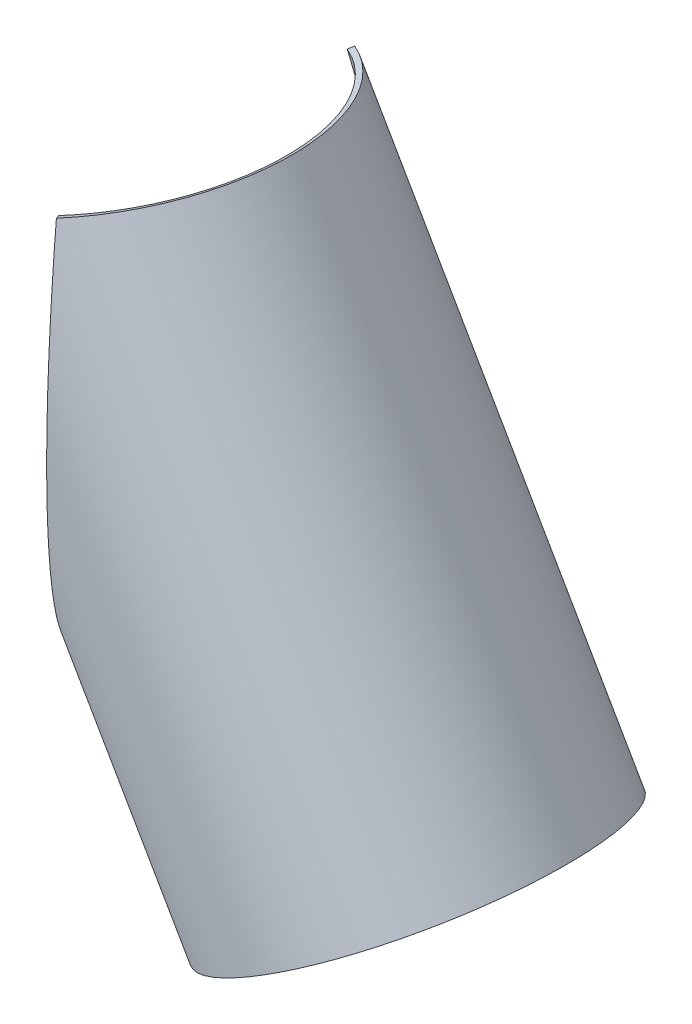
ISO-10303-21;
HEADER;
FILE_DESCRIPTION(('STEP AP214'),'2;1');
FILE_NAME('part.step','',(''),(''),'','','');
FILE_SCHEMA(('AUTOMOTIVE_DESIGN { 1 0 10303 214 1 1 1 1 }'));
ENDSEC;
DATA;
#1=APPLICATION_CONTEXT('core data for automotive mechanical design processes');
#2=APPLICATION_PROTOCOL_DEFINITION('international standard','automotive_design',2000,#1);
#3=PRODUCT_CONTEXT('',#1,'mechanical');
#4=PRODUCT('Part','Part','',(#3));
#5=PRODUCT_RELATED_PRODUCT_CATEGORY('part','',(#4));
#6=PRODUCT_DEFINITION_FORMATION('','',#4);
#7=PRODUCT_DEFINITION_CONTEXT('part definition',#1,'design');
#8=PRODUCT_DEFINITION('design','',#6,#7);
#9=PRODUCT_DEFINITION_SHAPE('','',#8);
#10=(LENGTH_UNIT() NAMED_UNIT(*) SI_UNIT(.MILLI.,.METRE.));
#11=(NAMED_UNIT(*) PLANE_ANGLE_UNIT() SI_UNIT($,.RADIAN.));
#12=(NAMED_UNIT(*) SI_UNIT($,.STERADIAN.) SOLID_ANGLE_UNIT());
#13=UNCERTAINTY_MEASURE_WITH_UNIT(LENGTH_MEASURE(1.E-05),#10,'distance_accuracy_value','');
#14=(GEOMETRIC_REPRESENTATION_CONTEXT(3) GLOBAL_UNCERTAINTY_ASSIGNED_CONTEXT((#13)) GLOBAL_UNIT_ASSIGNED_CONTEXT((#10,
#11,#12)) REPRESENTATION_CONTEXT('',''));
#15=CARTESIAN_POINT('',(0.,0.,0.));
#16=DIRECTION('',(0.,0.,1.));
#17=DIRECTION('',(1.,0.,0.));
#18=AXIS2_PLACEMENT_3D('',#15,#16,#17);
#19=CARTESIAN_POINT('',(83.2830569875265,-492.249143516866,-0.48333333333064));
#20=DIRECTION('',(-0.00240562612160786,-0.00138888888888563,0.999996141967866));
#21=DIRECTION('',(-0.500000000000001,0.866025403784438,0.));
#22=AXIS2_PLACEMENT_3D('',#19,#20,#21);
#23=PLANE('',#22);
#24=DIRECTION('',(-0.866022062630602,-0.499998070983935,-0.0027777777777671));
#25=VECTOR('',#24,1.);
#26=CARTESIAN_POINT('',(161.081306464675,-626.999664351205,-0.483333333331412));
#27=LINE('',#26,#25);
#28=CARTESIAN_POINT('',(161.081306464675,-626.999664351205,-0.483333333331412));
#29=VERTEX_POINT('',#28);
#30=CARTESIAN_POINT('',(155.885174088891,-629.999652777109,-0.499999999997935));
#31=VERTEX_POINT('',#30);
#32=EDGE_CURVE('E13',#29,#31,#27,.T.);
#33=ORIENTED_EDGE('',*,*,#32,.F.);
#34=DIRECTION('',(-0.500000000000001,0.866025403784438,0.));
#35=VECTOR('',#34,1.);
#36=CARTESIAN_POINT('',(161.081306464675,-626.999664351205,-0.483333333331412));
#37=LINE('',#36,#35);
#38=CARTESIAN_POINT('',(5.4848075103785,-357.498622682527,-0.48333333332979));
#39=VERTEX_POINT('',#38);
#40=EDGE_CURVE('E102',#29,#39,#37,.T.);
#41=ORIENTED_EDGE('',*,*,#40,.T.);
#42=CARTESIAN_POINT('',(0.288675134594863,-360.498611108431,-0.499999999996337));
#43=CARTESIAN_POINT('',(5.48480751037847,-357.498622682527,-0.48333333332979));
#44=B_SPLINE_CURVE_WITH_KNOTS('',1,(#42,#43),.UNSPECIFIED.,.F.,.F.,(2,2),(0.,1.),.UNSPECIFIED.);
#45=CARTESIAN_POINT('',(0.288675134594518,-360.49861110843,-0.499999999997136));
#46=VERTEX_POINT('',#45);
#47=EDGE_CURVE('E50',#39,#46,#44,.F.);
#48=ORIENTED_EDGE('',*,*,#47,.T.);
#49=DIRECTION('',(0.500000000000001,-0.866025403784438,0.));
#50=VECTOR('',#49,1.);
#51=CARTESIAN_POINT('',(-624.384266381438,721.466661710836,-0.499999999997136));
#52=LINE('',#51,#50);
#53=EDGE_CURVE('E101',#31,#46,#52,.F.);
#54=ORIENTED_EDGE('',*,*,#53,.F.);
#55=EDGE_LOOP('',(#33,#41,#48,#54));
#56=FACE_BOUND('',#55,.T.);
#57=ADVANCED_FACE('F40',(#56),#23,.T.);
#58=CARTESIAN_POINT('',(89.9999999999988,24.1154273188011,-155.8845726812));
#59=CARTESIAN_POINT('',(91.2303199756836,14.6015339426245,-158.015837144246));
#60=CARTESIAN_POINT('',(92.2782801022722,5.89425544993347,-159.831883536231));
#61=CARTESIAN_POINT('',(93.4048511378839,-3.95631461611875,-161.782395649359));
#62=CARTESIAN_POINT('',(93.6209355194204,-5.87477947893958,-162.156483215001));
#63=CARTESIAN_POINT('',(94.0355295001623,-9.60790002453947,-162.874333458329));
#64=CARTESIAN_POINT('',(94.2328226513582,-11.4113319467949,-163.216031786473));
#65=CARTESIAN_POINT('',(94.8115293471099,-16.7754240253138,-164.218463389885));
#66=CARTESIAN_POINT('',(95.1785069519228,-20.2796594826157,-164.854262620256));
#67=CARTESIAN_POINT('',(96.2268265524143,-30.5746552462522,-166.67028982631));
#68=CARTESIAN_POINT('',(96.8556732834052,-37.1476368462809,-167.759188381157));
#69=CARTESIAN_POINT('',(97.707110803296,-46.5639550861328,-169.23364945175));
#70=CARTESIAN_POINT('',(97.9754710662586,-49.6270895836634,-169.698515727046));
#71=CARTESIAN_POINT('',(98.490936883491,-55.6927838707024,-170.591483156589));
#72=CARTESIAN_POINT('',(98.7370367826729,-58.6844173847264,-171.017830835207));
#73=CARTESIAN_POINT('',(99.4421986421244,-67.5346602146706,-172.23931947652));
#74=CARTESIAN_POINT('',(99.868166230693,-73.2685867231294,-172.976913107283));
#75=CARTESIAN_POINT('',(100.44713870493,-81.6165256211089,-173.979534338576));
#76=CARTESIAN_POINT('',(100.629935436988,-84.3541162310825,-174.296160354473));
#77=CARTESIAN_POINT('',(100.978779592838,-89.7800593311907,-174.90047814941));
#78=CARTESIAN_POINT('',(101.144549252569,-92.464499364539,-175.187671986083));
#79=CARTESIAN_POINT('',(101.616938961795,-100.431625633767,-176.006011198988));
#80=CARTESIAN_POINT('',(101.898661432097,-105.628105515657,-176.493914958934));
#81=CARTESIAN_POINT('',(102.40069975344,-115.78830246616,-177.363232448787));
#82=CARTESIAN_POINT('',(102.620673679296,-120.743979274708,-177.744210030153));
#83=CARTESIAN_POINT('',(103.199454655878,-135.361770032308,-178.74697567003));
#84=CARTESIAN_POINT('',(103.476100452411,-144.750571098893,-179.225938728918));
#85=CARTESIAN_POINT('',(103.837074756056,-162.80031937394,-179.851025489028));
#86=CARTESIAN_POINT('',(103.922364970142,-171.520599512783,-179.999414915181));
#87=CARTESIAN_POINT('',(103.923195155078,-188.37880291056,-180.000581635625));
#88=CARTESIAN_POINT('',(103.838794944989,-196.502818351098,-179.853820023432));
#89=CARTESIAN_POINT('',(103.513694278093,-212.243139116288,-179.290910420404));
#90=CARTESIAN_POINT('',(103.273282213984,-219.848729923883,-178.874481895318));
#91=CARTESIAN_POINT('',(102.650424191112,-234.522868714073,-177.795695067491));
#92=CARTESIAN_POINT('',(102.266976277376,-241.612077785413,-177.131842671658));
#93=CARTESIAN_POINT('',(101.367692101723,-255.294487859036,-175.574153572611));
#94=CARTESIAN_POINT('',(100.852300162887,-261.881016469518,-174.681294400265));
#95=CARTESIAN_POINT('',(99.6972379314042,-274.578202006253,-172.680994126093));
#96=CARTESIAN_POINT('',(99.0572699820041,-280.693471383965,-171.57260391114));
#97=CARTESIAN_POINT('',(97.6617904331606,-292.451976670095,-169.15523997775));
#98=CARTESIAN_POINT('',(96.9068116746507,-298.090704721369,-167.847427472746));
#99=CARTESIAN_POINT('',(94.4762712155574,-314.326848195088,-163.63837486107));
#100=CARTESIAN_POINT('',(92.6344211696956,-324.255666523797,-160.447629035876));
#101=CARTESIAN_POINT('',(88.5666998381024,-342.288708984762,-153.402000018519));
#102=CARTESIAN_POINT('',(86.3325089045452,-350.429103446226,-149.533165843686));
#103=CARTESIAN_POINT('',(81.5150604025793,-364.937662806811,-141.188162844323));
#104=CARTESIAN_POINT('',(78.9321347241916,-371.30259110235,-136.714546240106));
#105=CARTESIAN_POINT('',(73.4484923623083,-382.283128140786,-127.216431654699));
#106=CARTESIAN_POINT('',(70.5472381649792,-386.897391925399,-122.191336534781));
#107=CARTESIAN_POINT('',(61.4198377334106,-398.100907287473,-106.382391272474));
#108=CARTESIAN_POINT('',(54.7609644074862,-402.067815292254,-94.848615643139));
#109=CARTESIAN_POINT('',(44.0924364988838,-402.656028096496,-76.3704701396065));
#110=CARTESIAN_POINT('',(40.423440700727,-401.958421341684,-70.0154676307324));
#111=CARTESIAN_POINT('',(32.883134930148,-398.743387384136,-56.955406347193));
#112=CARTESIAN_POINT('',(29.0141776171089,-396.227747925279,-50.2543443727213));
#113=CARTESIAN_POINT('',(21.0934277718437,-389.324252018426,-36.5358564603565));
#114=CARTESIAN_POINT('',(17.0485915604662,-384.942063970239,-29.529010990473));
#115=CARTESIAN_POINT('',(10.8779369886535,-376.93558819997,-18.841013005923));
#116=CARTESIAN_POINT('',(8.80180137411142,-374.024918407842,-15.2451608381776));
#117=CARTESIAN_POINT('',(5.66880866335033,-369.300957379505,-9.81865058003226));
#118=CARTESIAN_POINT('',(4.62241341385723,-367.668357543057,-8.00616145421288));
#119=CARTESIAN_POINT('',(3.04869536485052,-365.130142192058,-5.28055991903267));
#120=CARTESIAN_POINT('',(2.52491629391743,-364.271673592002,-4.37329365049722));
#121=CARTESIAN_POINT('',(1.46767045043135,-362.510832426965,-2.54220593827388));
#122=CARTESIAN_POINT('',(0.897464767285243,-361.547197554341,-1.55625915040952));
#123=CARTESIAN_POINT('',(0.288675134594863,-360.498611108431,-0.499999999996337));
#124=CARTESIAN_POINT('',(87.4019237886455,22.6154273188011,-150.688420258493));
#125=CARTESIAN_POINT('',(88.7388060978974,13.1630645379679,-152.748641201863));
#126=CARTESIAN_POINT('',(89.8862468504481,4.5132144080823,-154.504154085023));
#127=CARTESIAN_POINT('',(91.1268343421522,-5.27152822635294,-156.389649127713));
#128=CARTESIAN_POINT('',(91.3652072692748,-7.1771247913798,-156.751267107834));
#129=CARTESIAN_POINT('',(91.8233193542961,-10.8851201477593,-157.445189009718));
#130=CARTESIAN_POINT('',(92.0417104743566,-12.6763711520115,-157.775497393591));
#131=CARTESIAN_POINT('',(92.6833735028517,-18.0041153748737,-158.744514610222));
#132=CARTESIAN_POINT('',(93.0917559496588,-21.4844457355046,-159.359120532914));
#133=CARTESIAN_POINT('',(94.262463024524,-31.7087810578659,-161.114613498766));
#134=CARTESIAN_POINT('',(94.970461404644,-38.2360644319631,-162.167215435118));
#135=CARTESIAN_POINT('',(95.9365258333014,-47.5862027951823,-163.592527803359));
#136=CARTESIAN_POINT('',(96.2423896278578,-50.6276846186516,-164.041898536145));
#137=CARTESIAN_POINT('',(96.8325195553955,-56.6502715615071,-164.905100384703));
#138=CARTESIAN_POINT('',(97.1156474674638,-59.6205269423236,-165.317236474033));
#139=CARTESIAN_POINT('',(97.9309225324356,-68.4071958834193,-166.498008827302));
#140=CARTESIAN_POINT('',(98.4290030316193,-74.0994879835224,-167.211016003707));
#141=CARTESIAN_POINT('',(99.1139933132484,-82.3862174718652,-168.18021652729));
#142=CARTESIAN_POINT('',(99.3317338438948,-85.1036332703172,-168.486288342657));
#143=CARTESIAN_POINT('',(99.7501736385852,-90.4893953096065,-169.070462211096));
#144=CARTESIAN_POINT('',(99.9505456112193,-93.1538576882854,-169.34808291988));
#145=CARTESIAN_POINT('',(100.526121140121,-101.061409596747,-170.139144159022));
#146=CARTESIAN_POINT('',(100.875805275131,-106.218651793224,-170.610784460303));
#147=CARTESIAN_POINT('',(101.51194244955,-116.301426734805,-171.451124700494));
#148=CARTESIAN_POINT('',(101.797946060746,-121.218981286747,-171.819403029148));
#149=CARTESIAN_POINT('',(102.573247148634,-135.723311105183,-172.788743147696));
#150=CARTESIAN_POINT('',(102.978492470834,-145.037865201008,-173.251740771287));
#151=CARTESIAN_POINT('',(103.590968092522,-162.942409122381,-173.85599130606));
#152=CARTESIAN_POINT('',(103.799992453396,-171.591251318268,-173.999434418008));
#153=CARTESIAN_POINT('',(104.044129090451,-188.308981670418,-174.000562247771));
#154=CARTESIAN_POINT('',(104.079098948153,-196.364078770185,-173.858692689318));
#155=CARTESIAN_POINT('',(103.989317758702,-211.968537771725,-173.314546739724));
#156=CARTESIAN_POINT('',(103.864693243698,-219.507278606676,-172.911999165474));
#157=CARTESIAN_POINT('',(103.469209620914,-234.050142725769,-171.869171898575));
#158=CARTESIAN_POINT('',(103.197671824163,-241.074740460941,-171.227447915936));
#159=CARTESIAN_POINT('',(102.518358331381,-254.630150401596,-169.721681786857));
#160=CARTESIAN_POINT('',(102.110919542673,-261.154352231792,-168.858584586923));
#161=CARTESIAN_POINT('',(101.168001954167,-273.729056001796,-166.924960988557));
#162=CARTESIAN_POINT('',(100.632299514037,-279.784127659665,-165.853517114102));
#163=CARTESIAN_POINT('',(99.4414263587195,-291.424503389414,-163.516731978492));
#164=CARTESIAN_POINT('',(98.7867100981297,-297.005344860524,-162.252513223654));
#165=CARTESIAN_POINT('',(96.6512816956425,-313.07110530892,-158.183762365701));
#166=CARTESIAN_POINT('',(94.9987880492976,-322.890598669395,-155.09937473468));
#167=CARTESIAN_POINT('',(91.2930442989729,-340.714653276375,-148.288600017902));
#168=CARTESIAN_POINT('',(89.2322046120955,-348.754963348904,-144.54872698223));
#169=CARTESIAN_POINT('',(84.7446053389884,-363.073084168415,-136.481890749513));
#170=CARTESIAN_POINT('',(82.3181226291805,-369.347690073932,-132.157394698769));
#171=CARTESIAN_POINT('',(77.1300617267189,-380.157573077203,-122.975883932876));
#172=CARTESIAN_POINT('',(74.367940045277,-384.691508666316,-118.118291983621));
#173=CARTESIAN_POINT('',(65.6304334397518,-395.669918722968,-102.836311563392));
#174=CARTESIAN_POINT('',(59.1952893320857,-399.507656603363,-91.686995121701));
#175=CARTESIAN_POINT('',(48.8019647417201,-399.936980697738,-73.8247878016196));
#176=CARTESIAN_POINT('',(45.2146247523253,-399.192229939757,-67.681618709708));
#177=CARTESIAN_POINT('',(37.8164216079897,-395.895152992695,-55.0568928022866));
#178=CARTESIAN_POINT('',(34.0078780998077,-393.34463360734,-48.5791995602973));
#179=CARTESIAN_POINT('',(26.1855036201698,-386.38434065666,-35.3179945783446));
#180=CARTESIAN_POINT('',(22.1785368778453,-381.980288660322,-28.5447106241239));
#181=CARTESIAN_POINT('',(16.0465851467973,-373.951467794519,-18.2129792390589));
#182=CARTESIAN_POINT('',(13.9803410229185,-371.035087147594,-14.7369888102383));
#183=CARTESIAN_POINT('',(10.8574886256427,-366.305271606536,-9.49136222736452));
#184=CARTESIAN_POINT('',(9.81368870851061,-364.671173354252,-7.73928940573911));
#185=CARTESIAN_POINT('',(8.24267762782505,-362.131395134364,-5.10454125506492));
#186=CARTESIAN_POINT('',(7.71960210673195,-361.272520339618,-4.22751719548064));
#187=CARTESIAN_POINT('',(6.66337185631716,-359.511092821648,-2.45746574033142));
#188=CARTESIAN_POINT('',(6.09351241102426,-358.547257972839,-1.50438379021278));
#189=CARTESIAN_POINT('',(5.48480751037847,-357.498622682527,-0.48333333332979));
#190=B_SPLINE_SURFACE_WITH_KNOTS('',1,3,((#58,#59,#60,#61,#62,#63,#64,#65,#66,#67,#68,#69,#70,
#71,#72,#73,#74,#75,#76,#77,#78,#79,#80,#81,#82,#83,#84,#85,#86,#87,#88,#89,#90,#91,#92,#93,#94,
#95,#96,#97,#98,#99,#100,#101,#102,#103,#104,#105,#106,#107,#108,#109,#110,#111,#112,#113,#114,
#115,#116,#117,#118,#119,#120,#121,#122,#123),(#124,#125,#126,#127,#128,#129,#130,#131,#132,
#133,#134,#135,#136,#137,#138,#139,#140,#141,#142,#143,#144,#145,#146,#147,#148,#149,#150,#151,
#152,#153,#154,#155,#156,#157,#158,#159,#160,#161,#162,#163,#164,#165,#166,#167,#168,#169,#170,
#171,#172,#173,#174,#175,#176,#177,#178,#179,#180,#181,#182,#183,#184,#185,#186,#187,#188,
#189)),.UNSPECIFIED.,.F.,.F.,.F.,(2,2),(4,2,2,2,2,2,2,2,2,2,2,2,2,2,2,2,2,2,2,2,2,2,2,2,2,2,2,2,
2,2,2,2,4),(0.,1.),(0.,0.015625,0.01953125,0.0234375,0.03125,0.046875,0.0546875,0.0625,0.078125,
0.0859375,0.09375,0.109375,0.125,0.15625,0.1875,0.21875,0.25,0.28125,0.3125,0.34375,0.375,
0.4375,0.5,0.5625,0.625,0.75,0.8125,0.875,0.9375,0.96875,0.984375,0.9921875,1.),.UNSPECIFIED.);
#191=CARTESIAN_POINT('',(5.48480751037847,-357.498622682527,-0.48333333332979));
#192=CARTESIAN_POINT('',(6.09351241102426,-358.547257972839,-1.50438379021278));
#193=CARTESIAN_POINT('',(6.66337185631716,-359.511092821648,-2.45746574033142));
#194=CARTESIAN_POINT('',(7.71960210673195,-361.272520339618,-4.22751719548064));
#195=CARTESIAN_POINT('',(8.24267762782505,-362.131395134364,-5.10454125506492));
#196=CARTESIAN_POINT('',(9.81368870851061,-364.671173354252,-7.73928940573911));
#197=CARTESIAN_POINT('',(10.8574886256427,-366.305271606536,-9.49136222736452));
#198=CARTESIAN_POINT('',(13.9803410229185,-371.035087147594,-14.7369888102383));
#199=CARTESIAN_POINT('',(16.0465851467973,-373.951467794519,-18.2129792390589));
#200=CARTESIAN_POINT('',(22.1785368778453,-381.980288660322,-28.5447106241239));
#201=CARTESIAN_POINT('',(26.1855036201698,-386.38434065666,-35.3179945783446));
#202=CARTESIAN_POINT('',(34.0078780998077,-393.34463360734,-48.5791995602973));
#203=CARTESIAN_POINT('',(37.8164216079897,-395.895152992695,-55.0568928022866));
#204=CARTESIAN_POINT('',(45.2146247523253,-399.192229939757,-67.681618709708));
#205=CARTESIAN_POINT('',(48.8019647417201,-399.936980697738,-73.8247878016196));
#206=CARTESIAN_POINT('',(59.1952893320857,-399.507656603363,-91.686995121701));
#207=CARTESIAN_POINT('',(65.6304334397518,-395.669918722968,-102.836311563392));
#208=CARTESIAN_POINT('',(74.367940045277,-384.691508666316,-118.118291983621));
#209=CARTESIAN_POINT('',(77.1300617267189,-380.157573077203,-122.975883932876));
#210=CARTESIAN_POINT('',(82.3181226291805,-369.347690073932,-132.157394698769));
#211=CARTESIAN_POINT('',(84.7446053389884,-363.073084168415,-136.481890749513));
#212=CARTESIAN_POINT('',(89.2322046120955,-348.754963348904,-144.54872698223));
#213=CARTESIAN_POINT('',(91.2930442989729,-340.714653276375,-148.288600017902));
#214=CARTESIAN_POINT('',(94.9987880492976,-322.890598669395,-155.09937473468));
#215=CARTESIAN_POINT('',(96.6512816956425,-313.07110530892,-158.183762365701));
#216=CARTESIAN_POINT('',(98.7867100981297,-297.005344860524,-162.252513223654));
#217=CARTESIAN_POINT('',(99.4414263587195,-291.424503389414,-163.516731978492));
#218=CARTESIAN_POINT('',(100.632299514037,-279.784127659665,-165.853517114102));
#219=CARTESIAN_POINT('',(101.168001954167,-273.729056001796,-166.924960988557));
#220=CARTESIAN_POINT('',(102.110919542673,-261.154352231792,-168.858584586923));
#221=CARTESIAN_POINT('',(102.518358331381,-254.630150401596,-169.721681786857));
#222=CARTESIAN_POINT('',(103.197671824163,-241.074740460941,-171.227447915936));
#223=CARTESIAN_POINT('',(103.469209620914,-234.050142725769,-171.869171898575));
#224=CARTESIAN_POINT('',(103.864693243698,-219.507278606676,-172.911999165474));
#225=CARTESIAN_POINT('',(103.989317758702,-211.968537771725,-173.314546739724));
#226=CARTESIAN_POINT('',(104.079098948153,-196.364078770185,-173.858692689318));
#227=CARTESIAN_POINT('',(104.044129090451,-188.308981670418,-174.000562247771));
#228=CARTESIAN_POINT('',(103.799992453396,-171.591251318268,-173.999434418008));
#229=CARTESIAN_POINT('',(103.590968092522,-162.942409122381,-173.85599130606));
#230=CARTESIAN_POINT('',(102.978492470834,-145.037865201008,-173.251740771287));
#231=CARTESIAN_POINT('',(102.573247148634,-135.723311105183,-172.788743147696));
#232=CARTESIAN_POINT('',(101.797946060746,-121.218981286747,-171.819403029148));
#233=CARTESIAN_POINT('',(101.51194244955,-116.301426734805,-171.451124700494));
#234=CARTESIAN_POINT('',(100.875805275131,-106.218651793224,-170.610784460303));
#235=CARTESIAN_POINT('',(100.526121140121,-101.061409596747,-170.139144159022));
#236=CARTESIAN_POINT('',(99.9505456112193,-93.1538576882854,-169.34808291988));
#237=CARTESIAN_POINT('',(99.7501736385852,-90.4893953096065,-169.070462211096));
#238=CARTESIAN_POINT('',(99.3317338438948,-85.1036332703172,-168.486288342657));
#239=CARTESIAN_POINT('',(99.1139933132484,-82.3862174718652,-168.18021652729));
#240=CARTESIAN_POINT('',(98.4290030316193,-74.0994879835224,-167.211016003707));
#241=CARTESIAN_POINT('',(97.9309225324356,-68.4071958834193,-166.498008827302));
#242=CARTESIAN_POINT('',(97.1156474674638,-59.6205269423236,-165.317236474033));
#243=CARTESIAN_POINT('',(96.8325195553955,-56.6502715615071,-164.905100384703));
#244=CARTESIAN_POINT('',(96.2423896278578,-50.6276846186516,-164.041898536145));
#245=CARTESIAN_POINT('',(95.9365258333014,-47.5862027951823,-163.592527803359));
#246=CARTESIAN_POINT('',(94.970461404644,-38.2360644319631,-162.167215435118));
#247=CARTESIAN_POINT('',(94.262463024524,-31.7087810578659,-161.114613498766));
#248=CARTESIAN_POINT('',(93.0917559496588,-21.4844457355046,-159.359120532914));
#249=CARTESIAN_POINT('',(92.6833735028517,-18.0041153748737,-158.744514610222));
#250=CARTESIAN_POINT('',(92.0417104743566,-12.6763711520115,-157.775497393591));
#251=CARTESIAN_POINT('',(91.8233193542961,-10.8851201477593,-157.445189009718));
#252=CARTESIAN_POINT('',(91.3652072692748,-7.1771247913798,-156.751267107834));
#253=CARTESIAN_POINT('',(91.1268343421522,-5.27152822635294,-156.389649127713));
#254=CARTESIAN_POINT('',(89.8862468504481,4.5132144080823,-154.504154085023));
#255=CARTESIAN_POINT('',(88.7388060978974,13.1630645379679,-152.748641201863));
#256=CARTESIAN_POINT('',(87.4019237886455,22.6154273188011,-150.688420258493));
#257=B_SPLINE_CURVE_WITH_KNOTS('',3,(#191,#192,#193,#194,#195,#196,#197,#198,#199,#200,#201,
#202,#203,#204,#205,#206,#207,#208,#209,#210,#211,#212,#213,#214,#215,#216,#217,#218,#219,#220,
#221,#222,#223,#224,#225,#226,#227,#228,#229,#230,#231,#232,#233,#234,#235,#236,#237,#238,#239,
#240,#241,#242,#243,#244,#245,#246,#247,#248,#249,#250,#251,#252,#253,#254,#255,#256),
.UNSPECIFIED.,.F.,.F.,(4,2,2,2,2,2,2,2,2,2,2,2,2,2,2,2,2,2,2,2,2,2,2,2,2,2,2,2,2,2,2,2,4),(0.,
0.0078125,0.015625,0.03125,0.0625,0.125,0.1875,0.25,0.375,0.4375,0.5,0.5625,0.625,0.65625,
0.6875,0.71875,0.75,0.78125,0.8125,0.84375,0.875,0.890625,0.90625,0.9140625,0.921875,0.9375,
0.9453125,0.953125,0.96875,0.9765625,0.98046875,0.984375,1.),.UNSPECIFIED.);
#258=CARTESIAN_POINT('',(87.4019237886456,22.6154273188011,-150.688420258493));
#259=VERTEX_POINT('',#258);
#260=EDGE_CURVE('E187',#259,#39,#257,.F.);
#261=CARTESIAN_POINT('',(87.4019237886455,22.6154273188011,-150.688420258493));
#262=CARTESIAN_POINT('',(89.9999999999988,24.1154273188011,-155.8845726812));
#263=B_SPLINE_CURVE_WITH_KNOTS('',1,(#261,#262),.UNSPECIFIED.,.F.,.F.,(2,2),(0.,1.),.UNSPECIFIED.);
#264=CARTESIAN_POINT('',(90.0000000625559,24.115426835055,-155.884572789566));
#265=VERTEX_POINT('',#264);
#266=EDGE_CURVE('E108',#259,#265,#263,.T.);
#267=CARTESIAN_POINT('',(89.9999999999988,24.1154273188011,-155.8845726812));
#268=CARTESIAN_POINT('',(91.2303199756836,14.6015339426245,-158.015837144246));
#269=CARTESIAN_POINT('',(92.2782801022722,5.89425544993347,-159.831883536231));
#270=CARTESIAN_POINT('',(93.4048511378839,-3.95631461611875,-161.782395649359));
#271=CARTESIAN_POINT('',(93.6209355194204,-5.87477947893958,-162.156483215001));
#272=CARTESIAN_POINT('',(94.0355295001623,-9.60790002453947,-162.874333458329));
#273=CARTESIAN_POINT('',(94.2328226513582,-11.4113319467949,-163.216031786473));
#274=CARTESIAN_POINT('',(94.8115293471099,-16.7754240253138,-164.218463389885));
#275=CARTESIAN_POINT('',(95.1785069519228,-20.2796594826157,-164.854262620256));
#276=CARTESIAN_POINT('',(96.2268265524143,-30.5746552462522,-166.67028982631));
#277=CARTESIAN_POINT('',(96.8556732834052,-37.1476368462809,-167.759188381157));
#278=CARTESIAN_POINT('',(97.707110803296,-46.5639550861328,-169.23364945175));
#279=CARTESIAN_POINT('',(97.9754710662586,-49.6270895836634,-169.698515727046));
#280=CARTESIAN_POINT('',(98.490936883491,-55.6927838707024,-170.591483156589));
#281=CARTESIAN_POINT('',(98.7370367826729,-58.6844173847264,-171.017830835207));
#282=CARTESIAN_POINT('',(99.4421986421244,-67.5346602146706,-172.23931947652));
#283=CARTESIAN_POINT('',(99.868166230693,-73.2685867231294,-172.976913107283));
#284=CARTESIAN_POINT('',(100.44713870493,-81.6165256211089,-173.979534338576));
#285=CARTESIAN_POINT('',(100.629935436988,-84.3541162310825,-174.296160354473));
#286=CARTESIAN_POINT('',(100.978779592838,-89.7800593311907,-174.90047814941));
#287=CARTESIAN_POINT('',(101.144549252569,-92.464499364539,-175.187671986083));
#288=CARTESIAN_POINT('',(101.616938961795,-100.431625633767,-176.006011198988));
#289=CARTESIAN_POINT('',(101.898661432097,-105.628105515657,-176.493914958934));
#290=CARTESIAN_POINT('',(102.40069975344,-115.78830246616,-177.363232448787));
#291=CARTESIAN_POINT('',(102.620673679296,-120.743979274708,-177.744210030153));
#292=CARTESIAN_POINT('',(103.199454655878,-135.361770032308,-178.74697567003));
#293=CARTESIAN_POINT('',(103.476100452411,-144.750571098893,-179.225938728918));
#294=CARTESIAN_POINT('',(103.837074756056,-162.80031937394,-179.851025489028));
#295=CARTESIAN_POINT('',(103.922364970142,-171.520599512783,-179.999414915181));
#296=CARTESIAN_POINT('',(103.923195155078,-188.37880291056,-180.000581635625));
#297=CARTESIAN_POINT('',(103.838794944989,-196.502818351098,-179.853820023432));
#298=CARTESIAN_POINT('',(103.513694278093,-212.243139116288,-179.290910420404));
#299=CARTESIAN_POINT('',(103.273282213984,-219.848729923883,-178.874481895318));
#300=CARTESIAN_POINT('',(102.650424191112,-234.522868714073,-177.795695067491));
#301=CARTESIAN_POINT('',(102.266976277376,-241.612077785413,-177.131842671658));
#302=CARTESIAN_POINT('',(101.367692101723,-255.294487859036,-175.574153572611));
#303=CARTESIAN_POINT('',(100.852300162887,-261.881016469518,-174.681294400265));
#304=CARTESIAN_POINT('',(99.6972379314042,-274.578202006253,-172.680994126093));
#305=CARTESIAN_POINT('',(99.0572699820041,-280.693471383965,-171.57260391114));
#306=CARTESIAN_POINT('',(97.6617904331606,-292.451976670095,-169.15523997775));
#307=CARTESIAN_POINT('',(96.9068116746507,-298.090704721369,-167.847427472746));
#308=CARTESIAN_POINT('',(94.4762712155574,-314.326848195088,-163.63837486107));
#309=CARTESIAN_POINT('',(92.6344211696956,-324.255666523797,-160.447629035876));
#310=CARTESIAN_POINT('',(88.5666998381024,-342.288708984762,-153.402000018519));
#311=CARTESIAN_POINT('',(86.3325089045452,-350.429103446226,-149.533165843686));
#312=CARTESIAN_POINT('',(81.5150604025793,-364.937662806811,-141.188162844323));
#313=CARTESIAN_POINT('',(78.9321347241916,-371.30259110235,-136.714546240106));
#314=CARTESIAN_POINT('',(73.4484923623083,-382.283128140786,-127.216431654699));
#315=CARTESIAN_POINT('',(70.5472381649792,-386.897391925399,-122.191336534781));
#316=CARTESIAN_POINT('',(61.4198377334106,-398.100907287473,-106.382391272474));
#317=CARTESIAN_POINT('',(54.7609644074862,-402.067815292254,-94.848615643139));
#318=CARTESIAN_POINT('',(44.0924364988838,-402.656028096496,-76.3704701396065));
#319=CARTESIAN_POINT('',(40.423440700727,-401.958421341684,-70.0154676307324));
#320=CARTESIAN_POINT('',(32.883134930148,-398.743387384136,-56.955406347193));
#321=CARTESIAN_POINT('',(29.0141776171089,-396.227747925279,-50.2543443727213));
#322=CARTESIAN_POINT('',(21.0934277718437,-389.324252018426,-36.5358564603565));
#323=CARTESIAN_POINT('',(17.0485915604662,-384.942063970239,-29.529010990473));
#324=CARTESIAN_POINT('',(10.8779369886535,-376.93558819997,-18.841013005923));
#325=CARTESIAN_POINT('',(8.80180137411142,-374.024918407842,-15.2451608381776));
#326=CARTESIAN_POINT('',(5.66880866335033,-369.300957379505,-9.81865058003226));
#327=CARTESIAN_POINT('',(4.62241341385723,-367.668357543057,-8.00616145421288));
#328=CARTESIAN_POINT('',(3.04869536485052,-365.130142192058,-5.28055991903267));
#329=CARTESIAN_POINT('',(2.52491629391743,-364.271673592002,-4.37329365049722));
#330=CARTESIAN_POINT('',(1.46767045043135,-362.510832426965,-2.54220593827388));
#331=CARTESIAN_POINT('',(0.897464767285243,-361.547197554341,-1.55625915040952));
#332=CARTESIAN_POINT('',(0.288675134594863,-360.498611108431,-0.499999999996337));
#333=B_SPLINE_CURVE_WITH_KNOTS('',3,(#267,#268,#269,#270,#271,#272,#273,#274,#275,#276,#277,
#278,#279,#280,#281,#282,#283,#284,#285,#286,#287,#288,#289,#290,#291,#292,#293,#294,#295,#296,
#297,#298,#299,#300,#301,#302,#303,#304,#305,#306,#307,#308,#309,#310,#311,#312,#313,#314,#315,
#316,#317,#318,#319,#320,#321,#322,#323,#324,#325,#326,#327,#328,#329,#330,#331,#332),
.UNSPECIFIED.,.F.,.F.,(4,2,2,2,2,2,2,2,2,2,2,2,2,2,2,2,2,2,2,2,2,2,2,2,2,2,2,2,2,2,2,2,4),(0.,
0.015625,0.01953125,0.0234375,0.03125,0.046875,0.0546875,0.0625,0.078125,0.0859375,0.09375,
0.109375,0.125,0.15625,0.1875,0.21875,0.25,0.28125,0.3125,0.34375,0.375,0.4375,0.5,0.5625,0.625,
0.75,0.8125,0.875,0.9375,0.96875,0.984375,0.9921875,1.),.UNSPECIFIED.);
#334=EDGE_CURVE('E116',#265,#46,#333,.T.);
#335=ORIENTED_EDGE('',*,*,#47,.F.);
#336=ORIENTED_EDGE('',*,*,#260,.F.);
#337=ORIENTED_EDGE('',*,*,#266,.T.);
#338=ORIENTED_EDGE('',*,*,#334,.T.);
#339=EDGE_LOOP('',(#335,#336,#337,#338));
#340=FACE_BOUND('',#339,.T.);
#341=ADVANCED_FACE('F121',(#340),#190,.F.);
#342=CARTESIAN_POINT('',(90.0000000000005,24.1154273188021,155.884572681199));
#343=CARTESIAN_POINT('',(92.1330967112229,24.6877713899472,154.652802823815));
#344=CARTESIAN_POINT('',(94.1751964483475,25.2347994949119,153.415491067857));
#345=CARTESIAN_POINT('',(97.1059531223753,26.0197106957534,151.564325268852));
#346=CARTESIAN_POINT('',(98.0608069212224,26.2754109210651,150.948060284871));
#347=CARTESIAN_POINT('',(99.9271056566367,26.7753541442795,149.719154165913));
#348=CARTESIAN_POINT('',(100.839261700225,27.0197989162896,149.106175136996));
#349=CARTESIAN_POINT('',(105.372885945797,28.234587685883,145.999606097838));
#350=CARTESIAN_POINT('',(108.843646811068,29.1645481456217,143.426672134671));
#351=CARTESIAN_POINT('',(115.5068186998,30.9500164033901,138.11703670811));
#352=CARTESIAN_POINT('',(118.700439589,31.805776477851,135.378747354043));
#353=CARTESIAN_POINT('',(124.811364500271,33.4431252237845,129.766447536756));
#354=CARTESIAN_POINT('',(127.724663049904,34.2237016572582,126.896993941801));
#355=CARTESIAN_POINT('',(133.3080607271,35.7199399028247,121.018076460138));
#356=CARTESIAN_POINT('',(135.975562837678,36.4347912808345,118.010456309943));
#357=CARTESIAN_POINT('',(141.06118398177,37.7973871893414,111.881971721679));
#358=CARTESIAN_POINT('',(143.477524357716,38.444616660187,108.763925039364));
#359=CARTESIAN_POINT('',(150.37922644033,40.2940041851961,99.2351337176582));
#360=CARTESIAN_POINT('',(154.504918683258,41.399322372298,92.6664942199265));
#361=CARTESIAN_POINT('',(161.827503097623,43.3617162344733,79.1874905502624));
#362=CARTESIAN_POINT('',(165.026574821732,44.2194395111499,72.270303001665));
#363=CARTESIAN_POINT('',(169.127073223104,45.3180550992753,61.7264420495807));
#364=CARTESIAN_POINT('',(170.377680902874,45.6530050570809,58.183771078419));
#365=CARTESIAN_POINT('',(172.647099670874,46.2607718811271,51.0581917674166));
#366=CARTESIAN_POINT('',(173.665072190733,46.5333797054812,47.4788434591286));
#367=CARTESIAN_POINT('',(178.191266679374,47.7463810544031,29.4704405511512));
#368=CARTESIAN_POINT('',(180.000607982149,48.2310118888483,14.6919246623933));
#369=CARTESIAN_POINT('',(179.999391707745,48.2306973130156,-14.7067491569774));
#370=CARTESIAN_POINT('',(178.188822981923,47.7457318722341,-29.4852741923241));
#371=CARTESIAN_POINT('',(173.66106930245,46.5323070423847,-47.4934857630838));
#372=CARTESIAN_POINT('',(172.642774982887,46.2596111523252,-51.0728193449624));
#373=CARTESIAN_POINT('',(170.372727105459,45.6516704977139,-58.1982884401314));
#374=CARTESIAN_POINT('',(169.121810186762,45.3166346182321,-61.7408748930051));
#375=CARTESIAN_POINT('',(165.020410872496,44.2177705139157,-72.284397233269));
#376=CARTESIAN_POINT('',(161.820774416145,43.3598939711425,-79.2012451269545));
#377=CARTESIAN_POINT('',(154.497187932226,41.3972505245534,-92.679370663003));
#378=CARTESIAN_POINT('',(150.37116079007,40.291825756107,-99.247161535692));
#379=CARTESIAN_POINT('',(143.471131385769,38.4428892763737,-108.772320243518));
#380=CARTESIAN_POINT('',(141.055662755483,37.7959134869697,-111.888859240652));
#381=CARTESIAN_POINT('',(135.972307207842,36.4339315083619,-118.01413411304));
#382=CARTESIAN_POINT('',(133.306219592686,35.7194542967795,-121.020016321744));
#383=CARTESIAN_POINT('',(127.726273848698,34.2241331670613,-126.895292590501));
#384=CARTESIAN_POINT('',(124.815053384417,33.4441122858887,-129.762811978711));
#385=CARTESIAN_POINT('',(118.708435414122,31.8079183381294,-135.3716520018));
#386=CARTESIAN_POINT('',(115.517096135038,30.9527711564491,-138.108355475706));
#387=CARTESIAN_POINT('',(108.858724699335,29.168588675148,-143.415146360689));
#388=CARTESIAN_POINT('',(105.390515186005,28.2393118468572,-145.986804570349));
#389=CARTESIAN_POINT('',(100.859917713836,27.0253339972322,-149.092198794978));
#390=CARTESIAN_POINT('',(99.9486296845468,26.7811188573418,-149.704785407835));
#391=CARTESIAN_POINT('',(98.0828671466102,26.2813255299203,-150.933724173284));
#392=CARTESIAN_POINT('',(97.1274128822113,26.025475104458,-151.550583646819));
#393=CARTESIAN_POINT('',(94.1921654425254,25.2393895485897,-153.405116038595));
#394=CARTESIAN_POINT('',(92.1434868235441,24.6906136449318,-154.646787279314));
#395=CARTESIAN_POINT('',(89.9999999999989,24.1154273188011,-155.8845726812));
#396=CARTESIAN_POINT('',(87.4019237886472,22.615427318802,150.688420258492));
#397=CARTESIAN_POINT('',(89.4734319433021,23.1522132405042,149.497709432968));
#398=CARTESIAN_POINT('',(91.4565835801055,23.66520762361,148.301641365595));
#399=CARTESIAN_POINT('',(94.3027421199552,24.4012760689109,146.512181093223));
#400=CARTESIAN_POINT('',(95.2300338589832,24.6410633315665,145.916458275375));
#401=CARTESIAN_POINT('',(97.0424590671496,25.1099026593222,144.728515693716));
#402=CARTESIAN_POINT('',(97.9282829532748,25.3391445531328,144.135969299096));
#403=CARTESIAN_POINT('',(102.33103262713,26.478372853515,141.132952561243));
#404=CARTESIAN_POINT('',(105.701601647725,27.3504875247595,138.645783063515));
#405=CARTESIAN_POINT('',(112.172423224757,29.0249022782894,133.513135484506));
#406=CARTESIAN_POINT('',(115.273851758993,29.8274350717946,130.866122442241));
#407=CARTESIAN_POINT('',(121.208370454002,31.3629356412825,125.440899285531));
#408=CARTESIAN_POINT('',(124.037569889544,32.0949574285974,122.667094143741));
#409=CARTESIAN_POINT('',(129.459786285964,33.4981376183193,116.984140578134));
#410=CARTESIAN_POINT('',(132.05028285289,34.1685298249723,114.076774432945));
#411=CARTESIAN_POINT('',(136.989096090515,35.4463661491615,108.15257266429));
#412=CARTESIAN_POINT('',(139.335686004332,36.0533251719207,105.138460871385));
#413=CARTESIAN_POINT('',(146.038151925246,37.7876836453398,95.9272959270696));
#414=CARTESIAN_POINT('',(150.044747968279,38.824241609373,89.5776110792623));
#415=CARTESIAN_POINT('',(157.15594305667,40.6645897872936,76.5479075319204));
#416=CARTESIAN_POINT('',(160.262657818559,41.468990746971,69.8612929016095));
#417=CARTESIAN_POINT('',(164.244786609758,42.4992656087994,59.6688939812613));
#418=CARTESIAN_POINT('',(165.459294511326,42.8133733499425,56.2443120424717));
#419=CARTESIAN_POINT('',(167.66320545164,43.3833192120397,49.3562520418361));
#420=CARTESIAN_POINT('',(168.651793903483,43.6389621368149,45.8962153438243));
#421=CARTESIAN_POINT('',(173.047325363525,44.776525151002,28.4880925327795));
#422=CARTESIAN_POINT('',(174.804438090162,45.2310018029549,14.2021938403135));
#423=CARTESIAN_POINT('',(174.80325676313,45.2307074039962,-14.2165241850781));
#424=CARTESIAN_POINT('',(173.044952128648,44.7759166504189,-28.5024317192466));
#425=CARTESIAN_POINT('',(168.647906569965,43.6379561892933,-45.910369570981));
#426=CARTESIAN_POINT('',(167.65900563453,43.3822305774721,-49.3703920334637));
#427=CARTESIAN_POINT('',(165.454483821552,42.8121214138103,-56.258345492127));
#428=CARTESIAN_POINT('',(164.239675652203,42.4979329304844,-59.682845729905));
#429=CARTESIAN_POINT('',(160.256672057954,41.467424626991,-69.8749173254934));
#430=CARTESIAN_POINT('',(157.149408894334,40.6628798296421,-76.5612036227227));
#431=CARTESIAN_POINT('',(150.037240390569,38.8222986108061,-89.5900583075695));
#432=CARTESIAN_POINT('',(146.030319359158,37.7856397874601,-95.9389228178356));
#433=CARTESIAN_POINT('',(139.329477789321,36.0517044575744,-105.146576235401));
#434=CARTESIAN_POINT('',(136.983734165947,35.4449844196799,-108.159230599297));
#435=CARTESIAN_POINT('',(132.047121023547,34.1677242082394,-114.080329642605));
#436=CARTESIAN_POINT('',(129.45799818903,33.4976826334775,-116.986015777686));
#437=CARTESIAN_POINT('',(124.039134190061,32.0953620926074,-122.665449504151));
#438=CARTESIAN_POINT('',(121.21195286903,31.3638612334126,-125.437384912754));
#439=CARTESIAN_POINT('',(115.281616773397,29.8294436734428,-130.85926360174));
#440=CARTESIAN_POINT('',(112.182403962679,29.0274857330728,-133.504743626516));
#441=CARTESIAN_POINT('',(105.716244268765,27.3542767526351,-138.634641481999));
#442=CARTESIAN_POINT('',(102.348152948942,26.4828031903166,-141.120577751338));
#443=CARTESIAN_POINT('',(97.9483426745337,25.3443353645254,-144.122458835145));
#444=CARTESIAN_POINT('',(97.063361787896,25.1153086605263,-144.714625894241));
#445=CARTESIAN_POINT('',(95.251457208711,24.6466102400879,-145.902600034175));
#446=CARTESIAN_POINT('',(94.3235821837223,24.4066826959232,-146.498897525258));
#447=CARTESIAN_POINT('',(91.4730620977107,23.6695145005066,-148.291612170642));
#448=CARTESIAN_POINT('',(89.4835212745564,23.1548818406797,-149.491894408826));
#449=CARTESIAN_POINT('',(87.4019237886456,22.6154273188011,-150.688420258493));
#450=B_SPLINE_SURFACE_WITH_KNOTS('',1,3,((#342,#343,#344,#345,#346,#347,#348,#349,#350,#351,
#352,#353,#354,#355,#356,#357,#358,#359,#360,#361,#362,#363,#364,#365,#366,#367,#368,#369,#370,
#371,#372,#373,#374,#375,#376,#377,#378,#379,#380,#381,#382,#383,#384,#385,#386,#387,#388,#389,
#390,#391,#392,#393,#394,#395),(#396,#397,#398,#399,#400,#401,#402,#403,#404,#405,#406,#407,
#408,#409,#410,#411,#412,#413,#414,#415,#416,#417,#418,#419,#420,#421,#422,#423,#424,#425,#426,
#427,#428,#429,#430,#431,#432,#433,#434,#435,#436,#437,#438,#439,#440,#441,#442,#443,#444,#445,
#446,#447,#448,#449)),.UNSPECIFIED.,.F.,.F.,.F.,(2,2),(4,2,2,2,2,2,2,2,2,2,2,2,2,2,2,2,2,2,2,2,
2,2,2,2,2,2,4),(0.,1.),(0.,0.015625,0.0234375,0.03125,0.0625,0.09375,0.125,0.15625,0.1875,0.25,
0.3125,0.34375,0.375,0.5,0.625,0.65625,0.6875,0.75,0.8125,0.84375,0.875,0.90625,0.9375,0.96875,
0.9765625,0.984375,1.),.UNSPECIFIED.);
#451=CARTESIAN_POINT('',(87.4019237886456,22.6154273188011,-150.688420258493));
#452=CARTESIAN_POINT('',(89.4835212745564,23.1548818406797,-149.491894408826));
#453=CARTESIAN_POINT('',(91.4730620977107,23.6695145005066,-148.291612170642));
#454=CARTESIAN_POINT('',(94.3235821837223,24.4066826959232,-146.498897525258));
#455=CARTESIAN_POINT('',(95.251457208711,24.6466102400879,-145.902600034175));
#456=CARTESIAN_POINT('',(97.063361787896,25.1153086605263,-144.714625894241));
#457=CARTESIAN_POINT('',(97.9483426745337,25.3443353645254,-144.122458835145));
#458=CARTESIAN_POINT('',(102.348152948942,26.4828031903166,-141.120577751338));
#459=CARTESIAN_POINT('',(105.716244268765,27.3542767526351,-138.634641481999));
#460=CARTESIAN_POINT('',(112.182403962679,29.0274857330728,-133.504743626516));
#461=CARTESIAN_POINT('',(115.281616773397,29.8294436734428,-130.85926360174));
#462=CARTESIAN_POINT('',(121.21195286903,31.3638612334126,-125.437384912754));
#463=CARTESIAN_POINT('',(124.039134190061,32.0953620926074,-122.665449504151));
#464=CARTESIAN_POINT('',(129.45799818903,33.4976826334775,-116.986015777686));
#465=CARTESIAN_POINT('',(132.047121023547,34.1677242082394,-114.080329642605));
#466=CARTESIAN_POINT('',(136.983734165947,35.4449844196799,-108.159230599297));
#467=CARTESIAN_POINT('',(139.329477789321,36.0517044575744,-105.146576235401));
#468=CARTESIAN_POINT('',(146.030319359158,37.7856397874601,-95.9389228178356));
#469=CARTESIAN_POINT('',(150.037240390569,38.8222986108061,-89.5900583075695));
#470=CARTESIAN_POINT('',(157.149408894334,40.6628798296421,-76.5612036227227));
#471=CARTESIAN_POINT('',(160.256672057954,41.467424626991,-69.8749173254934));
#472=CARTESIAN_POINT('',(164.239675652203,42.4979329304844,-59.682845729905));
#473=CARTESIAN_POINT('',(165.454483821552,42.8121214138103,-56.258345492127));
#474=CARTESIAN_POINT('',(167.65900563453,43.3822305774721,-49.3703920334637));
#475=CARTESIAN_POINT('',(168.647906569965,43.6379561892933,-45.910369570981));
#476=CARTESIAN_POINT('',(173.044952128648,44.7759166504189,-28.5024317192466));
#477=CARTESIAN_POINT('',(174.80325676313,45.2307074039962,-14.2165241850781));
#478=CARTESIAN_POINT('',(174.804438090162,45.2310018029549,14.2021938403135));
#479=CARTESIAN_POINT('',(173.047325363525,44.776525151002,28.4880925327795));
#480=CARTESIAN_POINT('',(168.651793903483,43.6389621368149,45.8962153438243));
#481=CARTESIAN_POINT('',(167.66320545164,43.3833192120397,49.3562520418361));
#482=CARTESIAN_POINT('',(165.459294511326,42.8133733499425,56.2443120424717));
#483=CARTESIAN_POINT('',(164.244786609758,42.4992656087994,59.6688939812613));
#484=CARTESIAN_POINT('',(160.262657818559,41.468990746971,69.8612929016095));
#485=CARTESIAN_POINT('',(157.15594305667,40.6645897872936,76.5479075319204));
#486=CARTESIAN_POINT('',(150.044747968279,38.824241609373,89.5776110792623));
#487=CARTESIAN_POINT('',(146.038151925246,37.7876836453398,95.9272959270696));
#488=CARTESIAN_POINT('',(139.335686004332,36.0533251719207,105.138460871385));
#489=CARTESIAN_POINT('',(136.989096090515,35.4463661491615,108.15257266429));
#490=CARTESIAN_POINT('',(132.05028285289,34.1685298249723,114.076774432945));
#491=CARTESIAN_POINT('',(129.459786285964,33.4981376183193,116.984140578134));
#492=CARTESIAN_POINT('',(124.037569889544,32.0949574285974,122.667094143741));
#493=CARTESIAN_POINT('',(121.208370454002,31.3629356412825,125.440899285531));
#494=CARTESIAN_POINT('',(115.273851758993,29.8274350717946,130.866122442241));
#495=CARTESIAN_POINT('',(112.172423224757,29.0249022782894,133.513135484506));
#496=CARTESIAN_POINT('',(105.701601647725,27.3504875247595,138.645783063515));
#497=CARTESIAN_POINT('',(102.33103262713,26.478372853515,141.132952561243));
#498=CARTESIAN_POINT('',(97.9282829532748,25.3391445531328,144.135969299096));
#499=CARTESIAN_POINT('',(97.0424590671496,25.1099026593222,144.728515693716));
#500=CARTESIAN_POINT('',(95.2300338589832,24.6410633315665,145.916458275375));
#501=CARTESIAN_POINT('',(94.3027421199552,24.4012760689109,146.512181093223));
#502=CARTESIAN_POINT('',(91.4565835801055,23.66520762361,148.301641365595));
#503=CARTESIAN_POINT('',(89.4734319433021,23.1522132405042,149.497709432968));
#504=CARTESIAN_POINT('',(87.4019237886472,22.615427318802,150.688420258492));
#505=B_SPLINE_CURVE_WITH_KNOTS('',3,(#451,#452,#453,#454,#455,#456,#457,#458,#459,#460,#461,
#462,#463,#464,#465,#466,#467,#468,#469,#470,#471,#472,#473,#474,#475,#476,#477,#478,#479,#480,
#481,#482,#483,#484,#485,#486,#487,#488,#489,#490,#491,#492,#493,#494,#495,#496,#497,#498,#499,
#500,#501,#502,#503,#504),.UNSPECIFIED.,.F.,.F.,(4,2,2,2,2,2,2,2,2,2,2,2,2,2,2,2,2,2,2,2,2,2,2,
2,2,2,4),(0.,0.015625,0.0234375,0.03125,0.0625,0.09375,0.125,0.15625,0.1875,0.25,0.3125,0.34375,
0.375,0.5,0.625,0.65625,0.6875,0.75,0.8125,0.84375,0.875,0.90625,0.9375,0.96875,0.9765625,
0.984375,1.),.UNSPECIFIED.);
#506=CARTESIAN_POINT('',(87.4019237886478,22.6154273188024,150.688420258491));
#507=VERTEX_POINT('',#506);
#508=EDGE_CURVE('E179',#507,#259,#505,.F.);
#509=CARTESIAN_POINT('',(87.4019237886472,22.615427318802,150.688420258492));
#510=CARTESIAN_POINT('',(90.0000000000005,24.1154273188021,155.884572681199));
#511=B_SPLINE_CURVE_WITH_KNOTS('',1,(#509,#510),.UNSPECIFIED.,.F.,.F.,(2,2),(0.,1.),.UNSPECIFIED.);
#512=CARTESIAN_POINT('',(90.0000002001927,24.115427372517,155.884572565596));
#513=VERTEX_POINT('',#512);
#514=EDGE_CURVE('E90',#507,#513,#511,.T.);
#515=CARTESIAN_POINT('',(90.0000000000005,24.1154273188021,155.884572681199));
#516=CARTESIAN_POINT('',(92.1330967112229,24.6877713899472,154.652802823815));
#517=CARTESIAN_POINT('',(94.1751964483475,25.2347994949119,153.415491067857));
#518=CARTESIAN_POINT('',(97.1059531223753,26.0197106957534,151.564325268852));
#519=CARTESIAN_POINT('',(98.0608069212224,26.2754109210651,150.948060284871));
#520=CARTESIAN_POINT('',(99.9271056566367,26.7753541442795,149.719154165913));
#521=CARTESIAN_POINT('',(100.839261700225,27.0197989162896,149.106175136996));
#522=CARTESIAN_POINT('',(105.372885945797,28.234587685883,145.999606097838));
#523=CARTESIAN_POINT('',(108.843646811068,29.1645481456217,143.426672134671));
#524=CARTESIAN_POINT('',(115.5068186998,30.9500164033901,138.11703670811));
#525=CARTESIAN_POINT('',(118.700439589,31.805776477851,135.378747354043));
#526=CARTESIAN_POINT('',(124.811364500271,33.4431252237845,129.766447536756));
#527=CARTESIAN_POINT('',(127.724663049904,34.2237016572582,126.896993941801));
#528=CARTESIAN_POINT('',(133.3080607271,35.7199399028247,121.018076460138));
#529=CARTESIAN_POINT('',(135.975562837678,36.4347912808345,118.010456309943));
#530=CARTESIAN_POINT('',(141.06118398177,37.7973871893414,111.881971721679));
#531=CARTESIAN_POINT('',(143.477524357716,38.444616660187,108.763925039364));
#532=CARTESIAN_POINT('',(150.37922644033,40.2940041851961,99.2351337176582));
#533=CARTESIAN_POINT('',(154.504918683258,41.399322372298,92.6664942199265));
#534=CARTESIAN_POINT('',(161.827503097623,43.3617162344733,79.1874905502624));
#535=CARTESIAN_POINT('',(165.026574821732,44.2194395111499,72.270303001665));
#536=CARTESIAN_POINT('',(169.127073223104,45.3180550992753,61.7264420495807));
#537=CARTESIAN_POINT('',(170.377680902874,45.6530050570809,58.183771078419));
#538=CARTESIAN_POINT('',(172.647099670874,46.2607718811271,51.0581917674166));
#539=CARTESIAN_POINT('',(173.665072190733,46.5333797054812,47.4788434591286));
#540=CARTESIAN_POINT('',(178.191266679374,47.7463810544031,29.4704405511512));
#541=CARTESIAN_POINT('',(180.000607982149,48.2310118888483,14.6919246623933));
#542=CARTESIAN_POINT('',(179.999391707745,48.2306973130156,-14.7067491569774));
#543=CARTESIAN_POINT('',(178.188822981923,47.7457318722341,-29.4852741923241));
#544=CARTESIAN_POINT('',(173.66106930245,46.5323070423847,-47.4934857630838));
#545=CARTESIAN_POINT('',(172.642774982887,46.2596111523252,-51.0728193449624));
#546=CARTESIAN_POINT('',(170.372727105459,45.6516704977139,-58.1982884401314));
#547=CARTESIAN_POINT('',(169.121810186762,45.3166346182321,-61.7408748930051));
#548=CARTESIAN_POINT('',(165.020410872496,44.2177705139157,-72.284397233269));
#549=CARTESIAN_POINT('',(161.820774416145,43.3598939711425,-79.2012451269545));
#550=CARTESIAN_POINT('',(154.497187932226,41.3972505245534,-92.679370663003));
#551=CARTESIAN_POINT('',(150.37116079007,40.291825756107,-99.247161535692));
#552=CARTESIAN_POINT('',(143.471131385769,38.4428892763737,-108.772320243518));
#553=CARTESIAN_POINT('',(141.055662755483,37.7959134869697,-111.888859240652));
#554=CARTESIAN_POINT('',(135.972307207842,36.4339315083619,-118.01413411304));
#555=CARTESIAN_POINT('',(133.306219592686,35.7194542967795,-121.020016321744));
#556=CARTESIAN_POINT('',(127.726273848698,34.2241331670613,-126.895292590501));
#557=CARTESIAN_POINT('',(124.815053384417,33.4441122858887,-129.762811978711));
#558=CARTESIAN_POINT('',(118.708435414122,31.8079183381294,-135.3716520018));
#559=CARTESIAN_POINT('',(115.517096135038,30.9527711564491,-138.108355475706));
#560=CARTESIAN_POINT('',(108.858724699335,29.168588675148,-143.415146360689));
#561=CARTESIAN_POINT('',(105.390515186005,28.2393118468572,-145.986804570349));
#562=CARTESIAN_POINT('',(100.859917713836,27.0253339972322,-149.092198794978));
#563=CARTESIAN_POINT('',(99.9486296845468,26.7811188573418,-149.704785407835));
#564=CARTESIAN_POINT('',(98.0828671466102,26.2813255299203,-150.933724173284));
#565=CARTESIAN_POINT('',(97.1274128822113,26.025475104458,-151.550583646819));
#566=CARTESIAN_POINT('',(94.1921654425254,25.2393895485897,-153.405116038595));
#567=CARTESIAN_POINT('',(92.1434868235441,24.6906136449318,-154.646787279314));
#568=CARTESIAN_POINT('',(89.9999999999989,24.1154273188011,-155.8845726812));
#569=B_SPLINE_CURVE_WITH_KNOTS('',3,(#515,#516,#517,#518,#519,#520,#521,#522,#523,#524,#525,
#526,#527,#528,#529,#530,#531,#532,#533,#534,#535,#536,#537,#538,#539,#540,#541,#542,#543,#544,
#545,#546,#547,#548,#549,#550,#551,#552,#553,#554,#555,#556,#557,#558,#559,#560,#561,#562,#563,
#564,#565,#566,#567,#568),.UNSPECIFIED.,.F.,.F.,(4,2,2,2,2,2,2,2,2,2,2,2,2,2,2,2,2,2,2,2,2,2,2,
2,2,2,4),(0.,0.015625,0.0234375,0.03125,0.0625,0.09375,0.125,0.15625,0.1875,0.25,0.3125,0.34375,
0.375,0.5,0.625,0.65625,0.6875,0.75,0.8125,0.84375,0.875,0.90625,0.9375,0.96875,0.9765625,
0.984375,1.),.UNSPECIFIED.);
#570=EDGE_CURVE('E123',#513,#265,#569,.T.);
#571=ORIENTED_EDGE('',*,*,#266,.F.);
#572=ORIENTED_EDGE('',*,*,#508,.F.);
#573=ORIENTED_EDGE('',*,*,#514,.T.);
#574=ORIENTED_EDGE('',*,*,#570,.T.);
#575=EDGE_LOOP('',(#571,#572,#573,#574));
#576=FACE_BOUND('',#575,.T.);
#577=ADVANCED_FACE('F143',(#576),#450,.F.);
#578=CARTESIAN_POINT('',(90.0000000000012,24.1154273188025,155.884572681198));
#579=CARTESIAN_POINT('',(91.2303202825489,14.601531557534,158.01583767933));
#580=CARTESIAN_POINT('',(92.2782805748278,5.89425149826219,159.831884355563));
#581=CARTESIAN_POINT('',(93.4048516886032,-3.95631947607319,161.782396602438));
#582=CARTESIAN_POINT('',(93.6209360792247,-5.87478446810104,162.156484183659));
#583=CARTESIAN_POINT('',(94.0355300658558,-9.6079051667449,162.874334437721));
#584=CARTESIAN_POINT('',(94.2328232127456,-11.4113371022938,163.216032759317));
#585=CARTESIAN_POINT('',(94.8115299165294,-16.7754294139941,164.218464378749));
#586=CARTESIAN_POINT('',(95.1785075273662,-20.2796650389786,164.85426362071));
#587=CARTESIAN_POINT('',(96.2268271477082,-30.5746613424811,166.670290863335));
#588=CARTESIAN_POINT('',(96.8556738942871,-37.1476433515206,167.759189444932));
#589=CARTESIAN_POINT('',(97.7071114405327,-46.5639622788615,169.233650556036));
#590=CARTESIAN_POINT('',(97.9754717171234,-49.6270970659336,169.698516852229));
#591=CARTESIAN_POINT('',(98.4909375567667,-55.692791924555,170.591484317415));
#592=CARTESIAN_POINT('',(98.7370374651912,-58.6844257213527,171.017832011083));
#593=CARTESIAN_POINT('',(99.4421993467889,-67.5346693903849,172.239320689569));
#594=CARTESIAN_POINT('',(99.8681669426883,-73.2685964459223,172.976914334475));
#595=CARTESIAN_POINT('',(100.447139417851,-81.6165361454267,173.979535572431));
#596=CARTESIAN_POINT('',(100.629936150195,-84.3541270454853,174.296161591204));
#597=CARTESIAN_POINT('',(100.978780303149,-89.7800706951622,174.900479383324));
#598=CARTESIAN_POINT('',(101.144549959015,-92.4645109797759,175.1876732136));
#599=CARTESIAN_POINT('',(101.616939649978,-100.43163793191,176.006012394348));
#600=CARTESIAN_POINT('',(101.898662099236,-105.628118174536,176.493916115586));
#601=CARTESIAN_POINT('',(102.400700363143,-115.788315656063,177.363233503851));
#602=CARTESIAN_POINT('',(102.620674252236,-120.743992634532,177.744211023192));
#603=CARTESIAN_POINT('',(103.199455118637,-135.361783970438,178.746976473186));
#604=CARTESIAN_POINT('',(103.476100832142,-144.750585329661,179.225939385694));
#605=CARTESIAN_POINT('',(103.837074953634,-162.800334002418,179.851025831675));
#606=CARTESIAN_POINT('',(103.922365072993,-171.520614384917,179.999415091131));
#607=CARTESIAN_POINT('',(103.92319505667,-188.37881793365,180.000581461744));
#608=CARTESIAN_POINT('',(103.838794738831,-196.502833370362,179.853819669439));
#609=CARTESIAN_POINT('',(103.513693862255,-212.243154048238,179.290909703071));
#610=CARTESIAN_POINT('',(103.27328169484,-219.848744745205,178.874480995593));
#611=CARTESIAN_POINT('',(102.650423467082,-234.522883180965,177.795693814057));
#612=CARTESIAN_POINT('',(102.266975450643,-241.612092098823,177.131841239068));
#613=CARTESIAN_POINT('',(101.367691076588,-255.294501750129,175.574151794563));
#614=CARTESIAN_POINT('',(100.852299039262,-261.881030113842,174.681292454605));
#615=CARTESIAN_POINT('',(99.6972366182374,-274.578215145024,172.680991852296));
#616=CARTESIAN_POINT('',(99.0572685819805,-280.693484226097,171.572601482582));
#617=CARTESIAN_POINT('',(97.6617888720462,-292.451988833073,169.155237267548));
#618=CARTESIAN_POINT('',(96.9068100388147,-298.090716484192,167.847424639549));
#619=CARTESIAN_POINT('',(94.476269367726,-314.326858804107,163.638371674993));
#620=CARTESIAN_POINT('',(92.6344192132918,-324.255676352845,160.447625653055));
#621=CARTESIAN_POINT('',(88.5666977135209,-342.288717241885,153.401996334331));
#622=CARTESIAN_POINT('',(86.3325067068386,-350.429110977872,149.53316202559));
#623=CARTESIAN_POINT('',(81.5150581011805,-364.937668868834,141.188158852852));
#624=CARTESIAN_POINT('',(78.9321323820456,-371.302596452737,136.714542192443));
#625=CARTESIAN_POINT('',(73.4484900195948,-382.28313215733,127.21642759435));
#626=CARTESIAN_POINT('',(70.5472358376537,-386.897395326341,122.191332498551));
#627=CARTESIAN_POINT('',(61.4198354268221,-398.10090902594,106.382387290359));
#628=CARTESIAN_POINT('',(54.7609623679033,-402.067815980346,94.8486121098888));
#629=CARTESIAN_POINT('',(44.092434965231,-402.656027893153,76.3704674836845));
#630=CARTESIAN_POINT('',(40.4234393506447,-401.958420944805,70.0154652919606));
#631=CARTESIAN_POINT('',(32.8831339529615,-398.743386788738,56.9554046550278));
#632=CARTESIAN_POINT('',(29.0141768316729,-396.227747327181,50.2543430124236));
#633=CARTESIAN_POINT('',(21.0934273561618,-389.324251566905,36.5358557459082));
#634=CARTESIAN_POINT('',(17.0485913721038,-384.942063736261,29.5290106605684));
#635=CARTESIAN_POINT('',(10.8779369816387,-376.935588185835,18.8410129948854));
#636=CARTESIAN_POINT('',(8.80180140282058,-374.024918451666,15.2451608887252));
#637=CARTESIAN_POINT('',(5.66880863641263,-369.300957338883,9.81865053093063));
#638=CARTESIAN_POINT('',(4.62241331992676,-367.668357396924,8.00616129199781));
#639=CARTESIAN_POINT('',(3.0486951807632,-365.130141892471,5.28055959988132));
#640=CARTESIAN_POINT('',(2.52491611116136,-364.271673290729,4.37329333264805));
#641=CARTESIAN_POINT('',(1.46767028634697,-362.510832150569,2.54220565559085));
#642=CARTESIAN_POINT('',(0.897464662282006,-361.547197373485,1.55625896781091));
#643=CARTESIAN_POINT('',(0.288675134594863,-360.498611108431,0.500000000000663));
#644=CARTESIAN_POINT('',(87.4019237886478,22.6154273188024,150.688420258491));
#645=CARTESIAN_POINT('',(88.7388064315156,13.1630621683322,152.748641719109));
#646=CARTESIAN_POINT('',(89.8862473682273,4.51321048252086,154.504154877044));
#647=CARTESIAN_POINT('',(91.1268349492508,-5.27153305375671,156.389650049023));
#648=CARTESIAN_POINT('',(91.3652078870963,-7.17712974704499,156.751268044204));
#649=CARTESIAN_POINT('',(91.8233199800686,-10.8851252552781,157.445189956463));
#650=CARTESIAN_POINT('',(92.0417110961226,-12.6763762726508,157.775498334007));
#651=CARTESIAN_POINT('',(92.6833741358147,-18.0041207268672,158.744515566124));
#652=CARTESIAN_POINT('',(93.0917565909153,-21.4844512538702,159.35912150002));
#653=CARTESIAN_POINT('',(94.2624636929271,-31.7087871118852,161.114614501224));
#654=CARTESIAN_POINT('',(94.9704620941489,-38.2360708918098,162.167216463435));
#655=CARTESIAN_POINT('',(95.9365265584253,-47.5862099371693,163.592528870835));
#656=CARTESIAN_POINT('',(96.2423903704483,-50.627692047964,164.041899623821));
#657=CARTESIAN_POINT('',(96.8325203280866,-56.6502795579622,164.905101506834));
#658=CARTESIAN_POINT('',(97.1156482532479,-59.6205352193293,165.317237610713));
#659=CARTESIAN_POINT('',(97.9309233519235,-68.4072049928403,166.498009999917));
#660=CARTESIAN_POINT('',(98.4290038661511,-74.0994976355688,167.211017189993));
#661=CARTESIAN_POINT('',(99.113994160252,-82.3862279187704,168.180217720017));
#662=CARTESIAN_POINT('',(99.3317346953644,-85.1036440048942,168.486289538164));
#663=CARTESIAN_POINT('',(99.750174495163,-90.4894065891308,169.07046340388));
#664=CARTESIAN_POINT('',(99.9505464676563,-93.1538692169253,169.34808410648));
#665=CARTESIAN_POINT('',(100.526121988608,-101.061421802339,170.139145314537));
#666=CARTESIAN_POINT('',(100.875806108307,-106.218664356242,170.6107855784));
#667=CARTESIAN_POINT('',(101.511943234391,-116.301439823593,171.451125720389));
#668=CARTESIAN_POINT('',(101.797946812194,-121.21899454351,171.819403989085));
#669=CARTESIAN_POINT('',(102.573247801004,-135.723324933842,172.78874392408));
#670=CARTESIAN_POINT('',(102.978493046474,-145.037879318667,173.251741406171));
#671=CARTESIAN_POINT('',(103.590968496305,-162.942423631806,173.855991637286));
#672=CARTESIAN_POINT('',(103.799992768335,-171.591266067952,173.999434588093));
#673=CARTESIAN_POINT('',(104.044129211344,-188.308996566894,174.000562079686));
#674=CARTESIAN_POINT('',(104.079098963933,-196.364093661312,173.858692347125));
#675=CARTESIAN_POINT('',(103.989317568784,-211.968552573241,173.314546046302));
#676=CARTESIAN_POINT('',(103.86469295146,-219.507293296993,172.91199829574));
#677=CARTESIAN_POINT('',(103.469209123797,-234.050157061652,171.869170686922));
#678=CARTESIAN_POINT('',(103.197671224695,-241.074754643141,171.227446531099));
#679=CARTESIAN_POINT('',(102.518357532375,-254.630164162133,169.721680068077));
#680=CARTESIAN_POINT('',(102.110918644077,-261.154365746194,168.858582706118));
#681=CARTESIAN_POINT('',(101.168000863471,-273.729069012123,166.924958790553));
#682=CARTESIAN_POINT('',(100.632298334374,-279.784140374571,165.853514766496));
#683=CARTESIAN_POINT('',(99.4414250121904,-291.424515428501,163.51672935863));
#684=CARTESIAN_POINT('',(98.7867086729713,-297.005356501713,162.252510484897));
#685=CARTESIAN_POINT('',(96.6512800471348,-313.07111580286,158.183759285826));
#686=CARTESIAN_POINT('',(94.9987862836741,-322.890608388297,155.09937146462));
#687=CARTESIAN_POINT('',(91.2930423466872,-340.714661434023,148.28859645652));
#688=CARTESIAN_POINT('',(89.2322025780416,-348.754970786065,144.548723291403));
#689=CARTESIAN_POINT('',(84.7446031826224,-363.073090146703,136.48188689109));
#690=CARTESIAN_POINT('',(82.3181204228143,-369.347695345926,132.157390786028));
#691=CARTESIAN_POINT('',(77.1300595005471,-380.157577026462,122.975880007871));
#692=CARTESIAN_POINT('',(74.3679378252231,-384.691512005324,118.118288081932));
#693=CARTESIAN_POINT('',(65.6304312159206,-395.669920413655,102.836307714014));
#694=CARTESIAN_POINT('',(59.1952873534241,-399.507657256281,91.6869917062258));
#695=CARTESIAN_POINT('',(48.8019632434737,-399.936980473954,73.8247852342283));
#696=CARTESIAN_POINT('',(45.2146234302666,-399.192229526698,67.6816164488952));
#697=CARTESIAN_POINT('',(37.816420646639,-395.895152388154,55.0568911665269));
#698=CARTESIAN_POINT('',(34.0078773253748,-393.34463300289,48.5791982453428));
#699=CARTESIAN_POINT('',(26.1855032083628,-386.384340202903,35.3179938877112));
#700=CARTESIAN_POINT('',(22.1785366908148,-381.980288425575,28.5447103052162));
#701=CARTESIAN_POINT('',(16.0465851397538,-373.951467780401,18.2129792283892));
#702=CARTESIAN_POINT('',(13.9803410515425,-371.035087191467,14.7369888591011));
#703=CARTESIAN_POINT('',(10.8574885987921,-366.305271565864,9.49136217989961));
#704=CARTESIAN_POINT('',(9.81368861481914,-364.67117320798,7.73928924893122));
#705=CARTESIAN_POINT('',(8.24267744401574,-362.131394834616,5.10454094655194));
#706=CARTESIAN_POINT('',(7.71960192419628,-361.272520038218,4.22751688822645));
#707=CARTESIAN_POINT('',(6.66337169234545,-359.511092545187,2.45746546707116));
#708=CARTESIAN_POINT('',(6.09351230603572,-358.547257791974,1.50438361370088));
#709=CARTESIAN_POINT('',(5.48480751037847,-357.498622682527,0.483333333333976));
#710=B_SPLINE_SURFACE_WITH_KNOTS('',1,3,((#578,#579,#580,#581,#582,#583,#584,#585,#586,#587,
#588,#589,#590,#591,#592,#593,#594,#595,#596,#597,#598,#599,#600,#601,#602,#603,#604,#605,#606,
#607,#608,#609,#610,#611,#612,#613,#614,#615,#616,#617,#618,#619,#620,#621,#622,#623,#624,#625,
#626,#627,#628,#629,#630,#631,#632,#633,#634,#635,#636,#637,#638,#639,#640,#641,#642,#643),
(#644,#645,#646,#647,#648,#649,#650,#651,#652,#653,#654,#655,#656,#657,#658,#659,#660,#661,#662,
#663,#664,#665,#666,#667,#668,#669,#670,#671,#672,#673,#674,#675,#676,#677,#678,#679,#680,#681,
#682,#683,#684,#685,#686,#687,#688,#689,#690,#691,#692,#693,#694,#695,#696,#697,#698,#699,#700,
#701,#702,#703,#704,#705,#706,#707,#708,#709)),.UNSPECIFIED.,.F.,.F.,.F.,(2,2),(4,2,2,2,2,2,2,2,
2,2,2,2,2,2,2,2,2,2,2,2,2,2,2,2,2,2,2,2,2,2,2,2,4),(0.,1.),(0.,0.015625,0.01953125,0.0234375,
0.03125,0.046875,0.0546875,0.0625,0.078125,0.0859375,0.09375,0.109375,0.125,0.15625,0.1875,
0.21875,0.25,0.28125,0.3125,0.34375,0.375,0.4375,0.5,0.5625,0.625,0.75,0.8125,0.875,0.9375,
0.96875,0.984375,0.9921875,1.),.UNSPECIFIED.);
#711=CARTESIAN_POINT('',(87.4019237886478,22.6154273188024,150.688420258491));
#712=CARTESIAN_POINT('',(88.7388064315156,13.1630621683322,152.748641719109));
#713=CARTESIAN_POINT('',(89.8862473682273,4.51321048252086,154.504154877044));
#714=CARTESIAN_POINT('',(91.1268349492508,-5.27153305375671,156.389650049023));
#715=CARTESIAN_POINT('',(91.3652078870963,-7.17712974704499,156.751268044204));
#716=CARTESIAN_POINT('',(91.8233199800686,-10.8851252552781,157.445189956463));
#717=CARTESIAN_POINT('',(92.0417110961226,-12.6763762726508,157.775498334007));
#718=CARTESIAN_POINT('',(92.6833741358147,-18.0041207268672,158.744515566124));
#719=CARTESIAN_POINT('',(93.0917565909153,-21.4844512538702,159.35912150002));
#720=CARTESIAN_POINT('',(94.2624636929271,-31.7087871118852,161.114614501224));
#721=CARTESIAN_POINT('',(94.9704620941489,-38.2360708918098,162.167216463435));
#722=CARTESIAN_POINT('',(95.9365265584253,-47.5862099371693,163.592528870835));
#723=CARTESIAN_POINT('',(96.2423903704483,-50.627692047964,164.041899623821));
#724=CARTESIAN_POINT('',(96.8325203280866,-56.6502795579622,164.905101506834));
#725=CARTESIAN_POINT('',(97.1156482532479,-59.6205352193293,165.317237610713));
#726=CARTESIAN_POINT('',(97.9309233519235,-68.4072049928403,166.498009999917));
#727=CARTESIAN_POINT('',(98.4290038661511,-74.0994976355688,167.211017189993));
#728=CARTESIAN_POINT('',(99.113994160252,-82.3862279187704,168.180217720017));
#729=CARTESIAN_POINT('',(99.3317346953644,-85.1036440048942,168.486289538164));
#730=CARTESIAN_POINT('',(99.750174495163,-90.4894065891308,169.07046340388));
#731=CARTESIAN_POINT('',(99.9505464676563,-93.1538692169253,169.34808410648));
#732=CARTESIAN_POINT('',(100.526121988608,-101.061421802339,170.139145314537));
#733=CARTESIAN_POINT('',(100.875806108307,-106.218664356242,170.6107855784));
#734=CARTESIAN_POINT('',(101.511943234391,-116.301439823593,171.451125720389));
#735=CARTESIAN_POINT('',(101.797946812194,-121.21899454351,171.819403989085));
#736=CARTESIAN_POINT('',(102.573247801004,-135.723324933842,172.78874392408));
#737=CARTESIAN_POINT('',(102.978493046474,-145.037879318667,173.251741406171));
#738=CARTESIAN_POINT('',(103.590968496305,-162.942423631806,173.855991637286));
#739=CARTESIAN_POINT('',(103.799992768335,-171.591266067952,173.999434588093));
#740=CARTESIAN_POINT('',(104.044129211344,-188.308996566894,174.000562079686));
#741=CARTESIAN_POINT('',(104.079098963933,-196.364093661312,173.858692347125));
#742=CARTESIAN_POINT('',(103.989317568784,-211.968552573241,173.314546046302));
#743=CARTESIAN_POINT('',(103.86469295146,-219.507293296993,172.91199829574));
#744=CARTESIAN_POINT('',(103.469209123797,-234.050157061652,171.869170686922));
#745=CARTESIAN_POINT('',(103.197671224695,-241.074754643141,171.227446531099));
#746=CARTESIAN_POINT('',(102.518357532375,-254.630164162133,169.721680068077));
#747=CARTESIAN_POINT('',(102.110918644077,-261.154365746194,168.858582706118));
#748=CARTESIAN_POINT('',(101.168000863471,-273.729069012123,166.924958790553));
#749=CARTESIAN_POINT('',(100.632298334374,-279.784140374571,165.853514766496));
#750=CARTESIAN_POINT('',(99.4414250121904,-291.424515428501,163.51672935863));
#751=CARTESIAN_POINT('',(98.7867086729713,-297.005356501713,162.252510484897));
#752=CARTESIAN_POINT('',(96.6512800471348,-313.07111580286,158.183759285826));
#753=CARTESIAN_POINT('',(94.9987862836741,-322.890608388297,155.09937146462));
#754=CARTESIAN_POINT('',(91.2930423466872,-340.714661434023,148.28859645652));
#755=CARTESIAN_POINT('',(89.2322025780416,-348.754970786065,144.548723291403));
#756=CARTESIAN_POINT('',(84.7446031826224,-363.073090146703,136.48188689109));
#757=CARTESIAN_POINT('',(82.3181204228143,-369.347695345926,132.157390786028));
#758=CARTESIAN_POINT('',(77.1300595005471,-380.157577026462,122.975880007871));
#759=CARTESIAN_POINT('',(74.3679378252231,-384.691512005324,118.118288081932));
#760=CARTESIAN_POINT('',(65.6304312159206,-395.669920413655,102.836307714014));
#761=CARTESIAN_POINT('',(59.1952873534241,-399.507657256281,91.6869917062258));
#762=CARTESIAN_POINT('',(48.8019632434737,-399.936980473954,73.8247852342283));
#763=CARTESIAN_POINT('',(45.2146234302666,-399.192229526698,67.6816164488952));
#764=CARTESIAN_POINT('',(37.816420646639,-395.895152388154,55.0568911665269));
#765=CARTESIAN_POINT('',(34.0078773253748,-393.34463300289,48.5791982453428));
#766=CARTESIAN_POINT('',(26.1855032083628,-386.384340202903,35.3179938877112));
#767=CARTESIAN_POINT('',(22.1785366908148,-381.980288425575,28.5447103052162));
#768=CARTESIAN_POINT('',(16.0465851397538,-373.951467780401,18.2129792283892));
#769=CARTESIAN_POINT('',(13.9803410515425,-371.035087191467,14.7369888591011));
#770=CARTESIAN_POINT('',(10.8574885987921,-366.305271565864,9.49136217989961));
#771=CARTESIAN_POINT('',(9.81368861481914,-364.67117320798,7.73928924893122));
#772=CARTESIAN_POINT('',(8.24267744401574,-362.131394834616,5.10454094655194));
#773=CARTESIAN_POINT('',(7.71960192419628,-361.272520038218,4.22751688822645));
#774=CARTESIAN_POINT('',(6.66337169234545,-359.511092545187,2.45746546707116));
#775=CARTESIAN_POINT('',(6.09351230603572,-358.547257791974,1.50438361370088));
#776=CARTESIAN_POINT('',(5.48480751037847,-357.498622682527,0.483333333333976));
#777=B_SPLINE_CURVE_WITH_KNOTS('',3,(#711,#712,#713,#714,#715,#716,#717,#718,#719,#720,#721,
#722,#723,#724,#725,#726,#727,#728,#729,#730,#731,#732,#733,#734,#735,#736,#737,#738,#739,#740,
#741,#742,#743,#744,#745,#746,#747,#748,#749,#750,#751,#752,#753,#754,#755,#756,#757,#758,#759,
#760,#761,#762,#763,#764,#765,#766,#767,#768,#769,#770,#771,#772,#773,#774,#775,#776),
.UNSPECIFIED.,.F.,.F.,(4,2,2,2,2,2,2,2,2,2,2,2,2,2,2,2,2,2,2,2,2,2,2,2,2,2,2,2,2,2,2,2,4),(0.,
0.015625,0.01953125,0.0234375,0.03125,0.046875,0.0546875,0.0625,0.078125,0.0859375,0.09375,
0.109375,0.125,0.15625,0.1875,0.21875,0.25,0.28125,0.3125,0.34375,0.375,0.4375,0.5,0.5625,0.625,
0.75,0.8125,0.875,0.9375,0.96875,0.984375,0.9921875,1.),.UNSPECIFIED.);
#778=CARTESIAN_POINT('',(5.4848075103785,-357.498622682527,0.483333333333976));
#779=VERTEX_POINT('',#778);
#780=EDGE_CURVE('E190',#507,#779,#777,.T.);
#781=CARTESIAN_POINT('',(5.48480751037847,-357.498622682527,0.483333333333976));
#782=CARTESIAN_POINT('',(0.288675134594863,-360.498611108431,0.500000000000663));
#783=B_SPLINE_CURVE_WITH_KNOTS('',1,(#781,#782),.UNSPECIFIED.,.F.,.F.,(2,2),(0.,1.),.UNSPECIFIED.);
#784=CARTESIAN_POINT('',(0.288675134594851,-360.498611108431,0.500000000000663));
#785=VERTEX_POINT('',#784);
#786=EDGE_CURVE('E269',#779,#785,#783,.T.);
#787=CARTESIAN_POINT('',(0.288675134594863,-360.498611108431,0.500000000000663));
#788=CARTESIAN_POINT('',(0.897464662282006,-361.547197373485,1.55625896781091));
#789=CARTESIAN_POINT('',(1.46767028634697,-362.510832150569,2.54220565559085));
#790=CARTESIAN_POINT('',(2.52491611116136,-364.271673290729,4.37329333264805));
#791=CARTESIAN_POINT('',(3.0486951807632,-365.130141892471,5.28055959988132));
#792=CARTESIAN_POINT('',(4.62241331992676,-367.668357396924,8.00616129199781));
#793=CARTESIAN_POINT('',(5.66880863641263,-369.300957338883,9.81865053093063));
#794=CARTESIAN_POINT('',(8.80180140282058,-374.024918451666,15.2451608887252));
#795=CARTESIAN_POINT('',(10.8779369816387,-376.935588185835,18.8410129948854));
#796=CARTESIAN_POINT('',(17.0485913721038,-384.942063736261,29.5290106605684));
#797=CARTESIAN_POINT('',(21.0934273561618,-389.324251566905,36.5358557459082));
#798=CARTESIAN_POINT('',(29.0141768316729,-396.227747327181,50.2543430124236));
#799=CARTESIAN_POINT('',(32.8831339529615,-398.743386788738,56.9554046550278));
#800=CARTESIAN_POINT('',(40.4234393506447,-401.958420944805,70.0154652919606));
#801=CARTESIAN_POINT('',(44.092434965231,-402.656027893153,76.3704674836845));
#802=CARTESIAN_POINT('',(54.7609623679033,-402.067815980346,94.8486121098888));
#803=CARTESIAN_POINT('',(61.4198354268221,-398.10090902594,106.382387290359));
#804=CARTESIAN_POINT('',(70.5472358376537,-386.897395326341,122.191332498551));
#805=CARTESIAN_POINT('',(73.4484900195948,-382.28313215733,127.21642759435));
#806=CARTESIAN_POINT('',(78.9321323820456,-371.302596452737,136.714542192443));
#807=CARTESIAN_POINT('',(81.5150581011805,-364.937668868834,141.188158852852));
#808=CARTESIAN_POINT('',(86.3325067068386,-350.429110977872,149.53316202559));
#809=CARTESIAN_POINT('',(88.5666977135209,-342.288717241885,153.401996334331));
#810=CARTESIAN_POINT('',(92.6344192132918,-324.255676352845,160.447625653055));
#811=CARTESIAN_POINT('',(94.476269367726,-314.326858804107,163.638371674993));
#812=CARTESIAN_POINT('',(96.9068100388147,-298.090716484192,167.847424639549));
#813=CARTESIAN_POINT('',(97.6617888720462,-292.451988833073,169.155237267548));
#814=CARTESIAN_POINT('',(99.0572685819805,-280.693484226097,171.572601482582));
#815=CARTESIAN_POINT('',(99.6972366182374,-274.578215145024,172.680991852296));
#816=CARTESIAN_POINT('',(100.852299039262,-261.881030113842,174.681292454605));
#817=CARTESIAN_POINT('',(101.367691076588,-255.294501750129,175.574151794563));
#818=CARTESIAN_POINT('',(102.266975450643,-241.612092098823,177.131841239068));
#819=CARTESIAN_POINT('',(102.650423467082,-234.522883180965,177.795693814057));
#820=CARTESIAN_POINT('',(103.27328169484,-219.848744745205,178.874480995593));
#821=CARTESIAN_POINT('',(103.513693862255,-212.243154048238,179.290909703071));
#822=CARTESIAN_POINT('',(103.838794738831,-196.502833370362,179.853819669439));
#823=CARTESIAN_POINT('',(103.92319505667,-188.37881793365,180.000581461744));
#824=CARTESIAN_POINT('',(103.922365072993,-171.520614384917,179.999415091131));
#825=CARTESIAN_POINT('',(103.837074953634,-162.800334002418,179.851025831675));
#826=CARTESIAN_POINT('',(103.476100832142,-144.750585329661,179.225939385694));
#827=CARTESIAN_POINT('',(103.199455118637,-135.361783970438,178.746976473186));
#828=CARTESIAN_POINT('',(102.620674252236,-120.743992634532,177.744211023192));
#829=CARTESIAN_POINT('',(102.400700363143,-115.788315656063,177.363233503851));
#830=CARTESIAN_POINT('',(101.898662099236,-105.628118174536,176.493916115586));
#831=CARTESIAN_POINT('',(101.616939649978,-100.43163793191,176.006012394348));
#832=CARTESIAN_POINT('',(101.144549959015,-92.4645109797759,175.1876732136));
#833=CARTESIAN_POINT('',(100.978780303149,-89.7800706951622,174.900479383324));
#834=CARTESIAN_POINT('',(100.629936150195,-84.3541270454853,174.296161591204));
#835=CARTESIAN_POINT('',(100.447139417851,-81.6165361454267,173.979535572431));
#836=CARTESIAN_POINT('',(99.8681669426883,-73.2685964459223,172.976914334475));
#837=CARTESIAN_POINT('',(99.4421993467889,-67.5346693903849,172.239320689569));
#838=CARTESIAN_POINT('',(98.7370374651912,-58.6844257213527,171.017832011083));
#839=CARTESIAN_POINT('',(98.4909375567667,-55.692791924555,170.591484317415));
#840=CARTESIAN_POINT('',(97.9754717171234,-49.6270970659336,169.698516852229));
#841=CARTESIAN_POINT('',(97.7071114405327,-46.5639622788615,169.233650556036));
#842=CARTESIAN_POINT('',(96.8556738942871,-37.1476433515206,167.759189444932));
#843=CARTESIAN_POINT('',(96.2268271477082,-30.5746613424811,166.670290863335));
#844=CARTESIAN_POINT('',(95.1785075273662,-20.2796650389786,164.85426362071));
#845=CARTESIAN_POINT('',(94.8115299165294,-16.7754294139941,164.218464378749));
#846=CARTESIAN_POINT('',(94.2328232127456,-11.4113371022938,163.216032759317));
#847=CARTESIAN_POINT('',(94.0355300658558,-9.6079051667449,162.874334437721));
#848=CARTESIAN_POINT('',(93.6209360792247,-5.87478446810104,162.156484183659));
#849=CARTESIAN_POINT('',(93.4048516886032,-3.95631947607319,161.782396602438));
#850=CARTESIAN_POINT('',(92.2782805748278,5.89425149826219,159.831884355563));
#851=CARTESIAN_POINT('',(91.2303202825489,14.601531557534,158.01583767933));
#852=CARTESIAN_POINT('',(90.0000000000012,24.1154273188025,155.884572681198));
#853=B_SPLINE_CURVE_WITH_KNOTS('',3,(#787,#788,#789,#790,#791,#792,#793,#794,#795,#796,#797,
#798,#799,#800,#801,#802,#803,#804,#805,#806,#807,#808,#809,#810,#811,#812,#813,#814,#815,#816,
#817,#818,#819,#820,#821,#822,#823,#824,#825,#826,#827,#828,#829,#830,#831,#832,#833,#834,#835,
#836,#837,#838,#839,#840,#841,#842,#843,#844,#845,#846,#847,#848,#849,#850,#851,#852),
.UNSPECIFIED.,.F.,.F.,(4,2,2,2,2,2,2,2,2,2,2,2,2,2,2,2,2,2,2,2,2,2,2,2,2,2,2,2,2,2,2,2,4),(0.,
0.0078125,0.015625,0.03125,0.0625,0.125,0.1875,0.25,0.375,0.4375,0.5,0.5625,0.625,0.65625,
0.6875,0.71875,0.75,0.78125,0.8125,0.84375,0.875,0.890625,0.90625,0.9140625,0.921875,0.9375,
0.9453125,0.953125,0.96875,0.9765625,0.98046875,0.984375,1.),.UNSPECIFIED.);
#854=EDGE_CURVE('E233',#513,#785,#853,.F.);
#855=ORIENTED_EDGE('',*,*,#514,.F.);
#856=ORIENTED_EDGE('',*,*,#780,.T.);
#857=ORIENTED_EDGE('',*,*,#786,.T.);
#858=ORIENTED_EDGE('',*,*,#854,.F.);
#859=EDGE_LOOP('',(#855,#856,#857,#858));
#860=FACE_BOUND('',#859,.T.);
#861=ADVANCED_FACE('F238',(#860),#710,.T.);
#862=CARTESIAN_POINT('',(83.2830569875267,-492.249143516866,0.483333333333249));
#863=DIRECTION('',(0.00240562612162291,0.00138888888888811,0.999996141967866));
#864=DIRECTION('',(-0.500000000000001,0.866025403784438,0.));
#865=AXIS2_PLACEMENT_3D('',#862,#863,#864);
#866=PLANE('',#865);
#867=ORIENTED_EDGE('',*,*,#786,.F.);
#868=DIRECTION('',(-0.500000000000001,0.866025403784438,0.));
#869=VECTOR('',#868,1.);
#870=CARTESIAN_POINT('',(161.081306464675,-626.999664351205,0.483333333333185));
#871=LINE('',#870,#869);
#872=CARTESIAN_POINT('',(161.081306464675,-626.999664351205,0.483333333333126));
#873=VERTEX_POINT('',#872);
#874=EDGE_CURVE('E196',#873,#779,#871,.T.);
#875=ORIENTED_EDGE('',*,*,#874,.F.);
#876=DIRECTION('',(-0.8660220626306,-0.499998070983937,0.00277777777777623));
#877=VECTOR('',#876,1.);
#878=CARTESIAN_POINT('',(161.081306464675,-626.999664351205,0.483333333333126));
#879=LINE('',#878,#877);
#880=CARTESIAN_POINT('',(155.885174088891,-629.999652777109,0.499999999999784));
#881=VERTEX_POINT('',#880);
#882=EDGE_CURVE('E44',#873,#881,#879,.T.);
#883=ORIENTED_EDGE('',*,*,#882,.T.);
#884=DIRECTION('',(0.500000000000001,-0.866025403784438,0.));
#885=VECTOR('',#884,1.);
#886=CARTESIAN_POINT('',(-624.384266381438,721.466661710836,0.499999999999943));
#887=LINE('',#886,#885);
#888=EDGE_CURVE('E293',#881,#785,#887,.F.);
#889=ORIENTED_EDGE('',*,*,#888,.T.);
#890=EDGE_LOOP('',(#867,#875,#883,#889));
#891=FACE_BOUND('',#890,.T.);
#892=ADVANCED_FACE('F214',(#891),#866,.F.);
#893=CARTESIAN_POINT('',(311.7691453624,-540.000000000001,0.));
#894=DIRECTION('',(-0.500000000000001,0.866025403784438,0.));
#895=DIRECTION('',(-0.866025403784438,-0.500000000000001,0.));
#896=AXIS2_PLACEMENT_3D('',#893,#894,#895);
#897=PLANE('',#896);
#898=CARTESIAN_POINT('',(311.7691453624,-540.000000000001,0.));
#899=DIRECTION('',(0.500000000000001,-0.866025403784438,0.));
#900=DIRECTION('',(0.866025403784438,0.500000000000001,0.));
#901=AXIS2_PLACEMENT_3D('',#898,#899,#900);
#902=CIRCLE('',#901,174.);
#903=EDGE_CURVE('E195',#29,#873,#902,.T.);
#904=ORIENTED_EDGE('',*,*,#903,.F.);
#905=ORIENTED_EDGE('',*,*,#32,.T.);
#906=CARTESIAN_POINT('',(311.769145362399,-540.,0.));
#907=DIRECTION('',(0.500000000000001,-0.866025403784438,0.));
#908=DIRECTION('',(0.866025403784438,0.500000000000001,0.));
#909=AXIS2_PLACEMENT_3D('',#906,#907,#908);
#910=CIRCLE('',#909,180.);
#911=EDGE_CURVE('E118',#31,#881,#910,.T.);
#912=ORIENTED_EDGE('',*,*,#911,.T.);
#913=ORIENTED_EDGE('',*,*,#882,.F.);
#914=EDGE_LOOP('',(#904,#905,#912,#913));
#915=FACE_BOUND('',#914,.T.);
#916=ADVANCED_FACE('F42',(#915),#897,.F.);
#917=CARTESIAN_POINT('',(-468.50029510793,811.466314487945,0.));
#918=DIRECTION('',(0.500000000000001,-0.866025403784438,0.));
#919=DIRECTION('',(0.866025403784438,0.500000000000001,0.));
#920=AXIS2_PLACEMENT_3D('',#917,#918,#919);
#921=CYLINDRICAL_SURFACE('',#920,180.);
#922=ORIENTED_EDGE('',*,*,#888,.F.);
#923=ORIENTED_EDGE('',*,*,#911,.F.);
#924=ORIENTED_EDGE('',*,*,#53,.T.);
#925=ORIENTED_EDGE('',*,*,#334,.F.);
#926=ORIENTED_EDGE('',*,*,#570,.F.);
#927=ORIENTED_EDGE('',*,*,#854,.T.);
#928=EDGE_LOOP('',(#922,#923,#924,#925,#926,#927));
#929=FACE_BOUND('',#928,.T.);
#930=ADVANCED_FACE('F115',(#929),#921,.T.);
#931=CARTESIAN_POINT('',(-468.50029510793,811.466314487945,0.));
#932=DIRECTION('',(0.500000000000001,-0.866025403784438,0.));
#933=DIRECTION('',(0.866025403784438,0.500000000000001,0.));
#934=AXIS2_PLACEMENT_3D('',#931,#932,#933);
#935=CYLINDRICAL_SURFACE('',#934,174.);
#936=ORIENTED_EDGE('',*,*,#874,.T.);
#937=ORIENTED_EDGE('',*,*,#780,.F.);
#938=ORIENTED_EDGE('',*,*,#508,.T.);
#939=ORIENTED_EDGE('',*,*,#260,.T.);
#940=ORIENTED_EDGE('',*,*,#40,.F.);
#941=ORIENTED_EDGE('',*,*,#903,.T.);
#942=EDGE_LOOP('',(#936,#937,#938,#939,#940,#941));
#943=FACE_BOUND('',#942,.T.);
#944=ADVANCED_FACE('F186',(#943),#935,.F.);
#945=CLOSED_SHELL('',(#57,#341,#577,#861,#892,#916,#930,#944));
#946=MANIFOLD_SOLID_BREP('B2',#945);
#947=ADVANCED_BREP_SHAPE_REPRESENTATION('',(#18,#946),#14);
#948=SHAPE_DEFINITION_REPRESENTATION(#9,#947);
ENDSEC;
END-ISO-10303-21;
